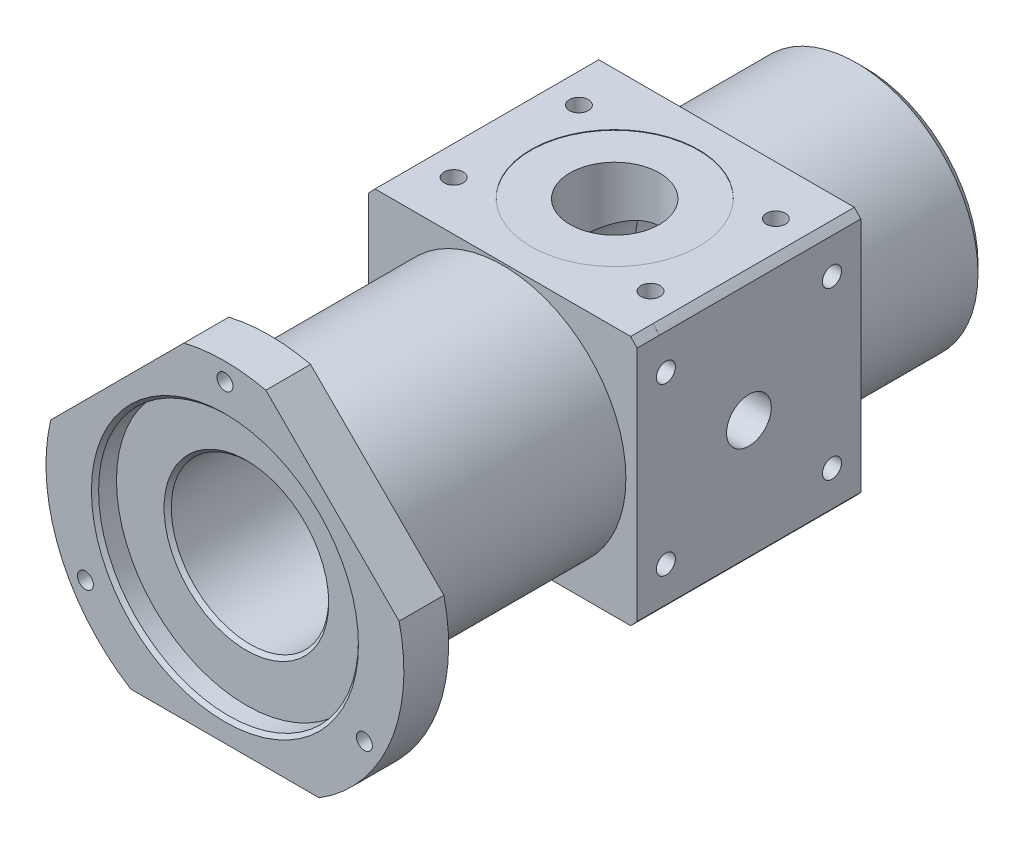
ISO-10303-21;
HEADER;
FILE_DESCRIPTION(('STEP AP214'),'2;1');
FILE_NAME('part.step','',(''),(''),'','','');
FILE_SCHEMA(('AUTOMOTIVE_DESIGN { 1 0 10303 214 1 1 1 1 }'));
ENDSEC;
DATA;
#1=APPLICATION_CONTEXT('core data for automotive mechanical design processes');
#2=APPLICATION_PROTOCOL_DEFINITION('international standard','automotive_design',2000,#1);
#3=PRODUCT_CONTEXT('',#1,'mechanical');
#4=PRODUCT('Part','Part','',(#3));
#5=PRODUCT_RELATED_PRODUCT_CATEGORY('part','',(#4));
#6=PRODUCT_DEFINITION_FORMATION('','',#4);
#7=PRODUCT_DEFINITION_CONTEXT('part definition',#1,'design');
#8=PRODUCT_DEFINITION('design','',#6,#7);
#9=PRODUCT_DEFINITION_SHAPE('','',#8);
#10=(LENGTH_UNIT() NAMED_UNIT(*) SI_UNIT(.MILLI.,.METRE.));
#11=(NAMED_UNIT(*) PLANE_ANGLE_UNIT() SI_UNIT($,.RADIAN.));
#12=(NAMED_UNIT(*) SI_UNIT($,.STERADIAN.) SOLID_ANGLE_UNIT());
#13=UNCERTAINTY_MEASURE_WITH_UNIT(LENGTH_MEASURE(1.E-05),#10,'distance_accuracy_value','');
#14=(GEOMETRIC_REPRESENTATION_CONTEXT(3) GLOBAL_UNCERTAINTY_ASSIGNED_CONTEXT((#13)) GLOBAL_UNIT_ASSIGNED_CONTEXT((#10,
#11,#12)) REPRESENTATION_CONTEXT('',''));
#15=CARTESIAN_POINT('',(0.,0.,0.));
#16=DIRECTION('',(0.,0.,1.));
#17=DIRECTION('',(1.,0.,0.));
#18=AXIS2_PLACEMENT_3D('',#15,#16,#17);
#19=CARTESIAN_POINT('',(0.,0.,36.0934000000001));
#20=DIRECTION('',(0.,0.,-1.));
#21=DIRECTION('',(-1.,0.,0.));
#22=AXIS2_PLACEMENT_3D('',#19,#20,#21);
#23=CONICAL_SURFACE('',#22,11.0109,0.256151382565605);
#24=CARTESIAN_POINT('',(10.5566504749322,3.12983961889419,36.0936000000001));
#25=CARTESIAN_POINT('',(10.5665285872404,3.13740554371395,36.0492257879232));
#26=CARTESIAN_POINT('',(10.5767142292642,3.14401502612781,36.0047578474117));
#27=CARTESIAN_POINT('',(10.5976590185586,3.15531868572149,35.9158012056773));
#28=CARTESIAN_POINT('',(10.6084170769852,3.16001636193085,35.8713126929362));
#29=CARTESIAN_POINT('',(10.6305015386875,3.1675217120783,35.7823181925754));
#30=CARTESIAN_POINT('',(10.641827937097,3.17032940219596,35.7378122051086));
#31=CARTESIAN_POINT('',(10.6650429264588,3.17407194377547,35.6487803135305));
#32=CARTESIAN_POINT('',(10.6769325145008,3.17500333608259,35.6042545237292));
#33=CARTESIAN_POINT('',(10.6890796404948,3.17499999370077,35.5598));
#34=B_SPLINE_CURVE_WITH_KNOTS('',3,(#24,#25,#26,#27,#28,#29,#30,#31,#32,#33),.UNSPECIFIED.,.F.,
.F.,(4,2,2,2,4),(0.,0.138244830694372,0.276235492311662,0.414224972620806,0.552468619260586),.UNSPECIFIED.);
#35=CARTESIAN_POINT('',(10.5566950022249,3.12987370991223,36.0934000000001));
#36=VERTEX_POINT('',#35);
#37=CARTESIAN_POINT('',(10.6890249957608,3.17499999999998,35.56));
#38=VERTEX_POINT('',#37);
#39=EDGE_CURVE('E331',#36,#38,#34,.T.);
#40=ORIENTED_EDGE('',*,*,#39,.F.);
#41=CARTESIAN_POINT('',(0.,0.,36.0934000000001));
#42=DIRECTION('',(0.,0.,-1.));
#43=DIRECTION('',(-1.,0.,0.));
#44=AXIS2_PLACEMENT_3D('',#41,#42,#43);
#45=CIRCLE('',#44,11.0109);
#46=CARTESIAN_POINT('',(6.32755754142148,9.01121159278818,36.0934000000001));
#47=VERTEX_POINT('',#46);
#48=EDGE_CURVE('E481',#47,#36,#45,.T.);
#49=ORIENTED_EDGE('',*,*,#48,.F.);
#50=CARTESIAN_POINT('',(6.34999999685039,9.16594504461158,35.5598));
#51=CARTESIAN_POINT('',(6.35003050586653,9.1377318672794,35.6482250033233));
#52=CARTESIAN_POINT('',(6.34817415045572,9.11072647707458,35.7369208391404));
#53=CARTESIAN_POINT('',(6.3406877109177,9.05913127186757,35.9148541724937));
#54=CARTESIAN_POINT('',(6.33505762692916,9.03454145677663,36.0040916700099));
#55=CARTESIAN_POINT('',(6.32754067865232,9.01115942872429,36.0936000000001));
#56=B_SPLINE_CURVE_WITH_KNOTS('',3,(#50,#51,#52,#53,#54,#55),.UNSPECIFIED.,.F.,.F.,(4,2,4),(0.,
0.278203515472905,0.55640702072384),.UNSPECIFIED.);
#57=CARTESIAN_POINT('',(6.35,9.16588131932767,35.56));
#58=VERTEX_POINT('',#57);
#59=EDGE_CURVE('E381',#58,#47,#56,.T.);
#60=ORIENTED_EDGE('',*,*,#59,.F.);
#61=CARTESIAN_POINT('',(0.,0.,35.56));
#62=DIRECTION('',(0.,0.,-1.));
#63=DIRECTION('',(-1.,0.,0.));
#64=AXIS2_PLACEMENT_3D('',#61,#62,#63);
#65=CIRCLE('',#64,11.1506);
#66=EDGE_CURVE('E511',#58,#38,#65,.T.);
#67=ORIENTED_EDGE('',*,*,#66,.T.);
#68=EDGE_LOOP('',(#40,#49,#60,#67));
#69=FACE_BOUND('',#68,.T.);
#70=ADVANCED_FACE('F49',(#69),#23,.F.);
#71=CARTESIAN_POINT('',(0.,0.,48.26));
#72=DIRECTION('',(0.,0.,-1.));
#73=DIRECTION('',(-1.,0.,0.));
#74=AXIS2_PLACEMENT_3D('',#71,#72,#73);
#75=PLANE('',#74);
#76=DIRECTION('',(-0.680954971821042,0.732325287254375,0.));
#77=VECTOR('',#76,1.);
#78=CARTESIAN_POINT('',(-0.267993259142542,37.5758371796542,48.26));
#79=LINE('',#78,#77);
#80=CARTESIAN_POINT('',(19.05,16.8005208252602,48.26));
#81=VERTEX_POINT('',#80);
#82=CARTESIAN_POINT('',(18.1392282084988,17.78,48.26));
#83=VERTEX_POINT('',#82);
#84=EDGE_CURVE('E71',#81,#83,#79,.T.);
#85=ORIENTED_EDGE('',*,*,#84,.F.);
#86=CARTESIAN_POINT('',(0.,0.,48.26));
#87=DIRECTION('',(0.,0.,-1.));
#88=DIRECTION('',(-1.,0.,0.));
#89=AXIS2_PLACEMENT_3D('',#86,#87,#88);
#90=CIRCLE('',#89,25.4);
#91=EDGE_CURVE('E460',#83,#81,#90,.T.);
#92=ORIENTED_EDGE('',*,*,#91,.F.);
#93=EDGE_LOOP('',(#85,#92));
#94=FACE_BOUND('',#93,.T.);
#95=ADVANCED_FACE('F559',(#94),#75,.F.);
#96=CARTESIAN_POINT('',(0.,0.,73.66));
#97=DIRECTION('',(0.,0.,-1.));
#98=DIRECTION('',(-1.,0.,0.));
#99=AXIS2_PLACEMENT_3D('',#96,#97,#98);
#100=CYLINDRICAL_SURFACE('',#99,17.4625);
#101=CARTESIAN_POINT('',(0.,0.,84.5312));
#102=DIRECTION('',(0.,0.,1.));
#103=DIRECTION('',(1.,0.,0.));
#104=AXIS2_PLACEMENT_3D('',#101,#102,#103);
#105=CIRCLE('',#104,17.4625);
#106=CARTESIAN_POINT('',(17.4625,0.,84.5312));
#107=VERTEX_POINT('',#106);
#108=EDGE_CURVE('E666',#107,#107,#105,.T.);
#109=ORIENTED_EDGE('',*,*,#108,.F.);
#110=EDGE_LOOP('',(#109));
#111=FACE_BOUND('',#110,.T.);
#112=CARTESIAN_POINT('',(0.,0.,51.435));
#113=DIRECTION('',(0.,0.,-1.));
#114=DIRECTION('',(-1.,0.,0.));
#115=AXIS2_PLACEMENT_3D('',#112,#113,#114);
#116=CIRCLE('',#115,17.4625);
#117=CARTESIAN_POINT('',(-17.4625,0.,51.435));
#118=VERTEX_POINT('',#117);
#119=EDGE_CURVE('E629',#118,#118,#116,.F.);
#120=ORIENTED_EDGE('',*,*,#119,.T.);
#121=EDGE_LOOP('',(#120));
#122=FACE_BOUND('',#121,.T.);
#123=ADVANCED_FACE('F563',(#111,#122),#100,.T.);
#124=CARTESIAN_POINT('',(0.,0.,90.8812));
#125=DIRECTION('',(0.,0.,-1.));
#126=DIRECTION('',(-1.,0.,0.));
#127=AXIS2_PLACEMENT_3D('',#124,#125,#126);
#128=CYLINDRICAL_SURFACE('',#127,25.4);
#129=DIRECTION('',(0.,0.,-1.));
#130=VECTOR('',#129,1.);
#131=CARTESIAN_POINT('',(19.05,-16.8005208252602,90.8812));
#132=LINE('',#131,#130);
#133=CARTESIAN_POINT('',(19.05,-16.8005208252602,19.685));
#134=VERTEX_POINT('',#133);
#135=CARTESIAN_POINT('',(19.05,-16.8005208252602,51.435));
#136=VERTEX_POINT('',#135);
#137=EDGE_CURVE('E659',#134,#136,#132,.F.);
#138=ORIENTED_EDGE('',*,*,#137,.T.);
#139=CARTESIAN_POINT('',(0.,0.,51.435));
#140=DIRECTION('',(0.,0.,-1.));
#141=DIRECTION('',(-1.,0.,0.));
#142=AXIS2_PLACEMENT_3D('',#139,#140,#141);
#143=CIRCLE('',#142,25.4);
#144=CARTESIAN_POINT('',(18.1392282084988,-17.78,51.435));
#145=VERTEX_POINT('',#144);
#146=EDGE_CURVE('E624',#145,#136,#143,.F.);
#147=ORIENTED_EDGE('',*,*,#146,.F.);
#148=DIRECTION('',(0.,0.,-1.));
#149=VECTOR('',#148,1.);
#150=CARTESIAN_POINT('',(18.1392282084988,-17.78,90.8812));
#151=LINE('',#150,#149);
#152=CARTESIAN_POINT('',(18.1392282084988,-17.78,19.685));
#153=VERTEX_POINT('',#152);
#154=EDGE_CURVE('E657',#145,#153,#151,.T.);
#155=ORIENTED_EDGE('',*,*,#154,.T.);
#156=CARTESIAN_POINT('',(0.,0.,19.685));
#157=DIRECTION('',(0.,0.,-1.));
#158=DIRECTION('',(-1.,0.,0.));
#159=AXIS2_PLACEMENT_3D('',#156,#157,#158);
#160=CIRCLE('',#159,25.4);
#161=EDGE_CURVE('E652',#134,#153,#160,.T.);
#162=ORIENTED_EDGE('',*,*,#161,.F.);
#163=EDGE_LOOP('',(#138,#147,#155,#162));
#164=FACE_BOUND('',#163,.T.);
#165=ADVANCED_FACE('F568',(#164),#128,.T.);
#166=ORIENTED_EDGE('',*,*,#91,.T.);
#167=DIRECTION('',(0.,0.,-1.));
#168=VECTOR('',#167,1.);
#169=CARTESIAN_POINT('',(19.05,16.8005208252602,90.8812));
#170=LINE('',#169,#168);
#171=CARTESIAN_POINT('',(19.05,16.8005208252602,19.685));
#172=VERTEX_POINT('',#171);
#173=EDGE_CURVE('E661',#81,#172,#170,.T.);
#174=ORIENTED_EDGE('',*,*,#173,.T.);
#175=CARTESIAN_POINT('',(0.,0.,19.685));
#176=DIRECTION('',(0.,0.,-1.));
#177=DIRECTION('',(-1.,0.,0.));
#178=AXIS2_PLACEMENT_3D('',#175,#176,#177);
#179=CIRCLE('',#178,25.4);
#180=CARTESIAN_POINT('',(18.1392282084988,17.78,19.685));
#181=VERTEX_POINT('',#180);
#182=EDGE_CURVE('E646',#181,#172,#179,.T.);
#183=ORIENTED_EDGE('',*,*,#182,.F.);
#184=DIRECTION('',(0.,0.,-1.));
#185=VECTOR('',#184,1.);
#186=CARTESIAN_POINT('',(18.1392282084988,17.78,90.8812));
#187=LINE('',#186,#185);
#188=EDGE_CURVE('E398',#181,#83,#187,.F.);
#189=ORIENTED_EDGE('',*,*,#188,.T.);
#190=EDGE_LOOP('',(#166,#174,#183,#189));
#191=FACE_BOUND('',#190,.T.);
#192=ADVANCED_FACE('F752',(#191),#128,.T.);
#193=DIRECTION('',(0.,0.,-1.));
#194=VECTOR('',#193,1.);
#195=CARTESIAN_POINT('',(-19.05,-16.8005208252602,90.8812));
#196=LINE('',#195,#194);
#197=CARTESIAN_POINT('',(-19.05,-16.8005208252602,51.435));
#198=VERTEX_POINT('',#197);
#199=CARTESIAN_POINT('',(-19.05,-16.8005208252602,19.685));
#200=VERTEX_POINT('',#199);
#201=EDGE_CURVE('E664',#198,#200,#196,.T.);
#202=ORIENTED_EDGE('',*,*,#201,.T.);
#203=CARTESIAN_POINT('',(0.,0.,19.685));
#204=DIRECTION('',(0.,0.,-1.));
#205=DIRECTION('',(-1.,0.,0.));
#206=AXIS2_PLACEMENT_3D('',#203,#204,#205);
#207=CIRCLE('',#206,25.4);
#208=CARTESIAN_POINT('',(-18.1392282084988,-17.78,19.685));
#209=VERTEX_POINT('',#208);
#210=EDGE_CURVE('E637',#209,#200,#207,.T.);
#211=ORIENTED_EDGE('',*,*,#210,.F.);
#212=DIRECTION('',(0.,0.,-1.));
#213=VECTOR('',#212,1.);
#214=CARTESIAN_POINT('',(-18.1392282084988,-17.78,90.8812));
#215=LINE('',#214,#213);
#216=CARTESIAN_POINT('',(-18.1392282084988,-17.78,51.435));
#217=VERTEX_POINT('',#216);
#218=EDGE_CURVE('E655',#209,#217,#215,.F.);
#219=ORIENTED_EDGE('',*,*,#218,.T.);
#220=CARTESIAN_POINT('',(0.,0.,51.435));
#221=DIRECTION('',(0.,0.,-1.));
#222=DIRECTION('',(-1.,0.,0.));
#223=AXIS2_PLACEMENT_3D('',#220,#221,#222);
#224=CIRCLE('',#223,25.4);
#225=EDGE_CURVE('E618',#198,#217,#224,.F.);
#226=ORIENTED_EDGE('',*,*,#225,.F.);
#227=EDGE_LOOP('',(#202,#211,#219,#226));
#228=FACE_BOUND('',#227,.T.);
#229=ADVANCED_FACE('F764',(#228),#128,.T.);
#230=DIRECTION('',(0.,0.,-1.));
#231=VECTOR('',#230,1.);
#232=CARTESIAN_POINT('',(5.80514849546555,24.7277223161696,90.8812));
#233=LINE('',#232,#231);
#234=CARTESIAN_POINT('',(5.80514849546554,24.7277223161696,90.8812));
#235=VERTEX_POINT('',#234);
#236=CARTESIAN_POINT('',(5.80514849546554,24.7277223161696,84.5312));
#237=VERTEX_POINT('',#236);
#238=EDGE_CURVE('E448',#235,#237,#233,.T.);
#239=ORIENTED_EDGE('',*,*,#238,.T.);
#240=CARTESIAN_POINT('',(0.,0.,84.5312));
#241=DIRECTION('',(0.,0.,1.));
#242=DIRECTION('',(1.,0.,0.));
#243=AXIS2_PLACEMENT_3D('',#240,#241,#242);
#244=CIRCLE('',#243,25.4);
#245=CARTESIAN_POINT('',(-5.80514849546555,24.7277223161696,84.5312));
#246=VERTEX_POINT('',#245);
#247=EDGE_CURVE('E671',#237,#246,#244,.T.);
#248=ORIENTED_EDGE('',*,*,#247,.T.);
#249=DIRECTION('',(0.,0.,-1.));
#250=VECTOR('',#249,1.);
#251=CARTESIAN_POINT('',(-5.80514849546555,24.7277223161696,90.8812));
#252=LINE('',#251,#250);
#253=CARTESIAN_POINT('',(-5.80514849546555,24.7277223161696,90.8812));
#254=VERTEX_POINT('',#253);
#255=EDGE_CURVE('E436',#246,#254,#252,.F.);
#256=ORIENTED_EDGE('',*,*,#255,.T.);
#257=CARTESIAN_POINT('',(0.,0.,90.8812));
#258=DIRECTION('',(0.,0.,1.));
#259=DIRECTION('',(1.,0.,0.));
#260=AXIS2_PLACEMENT_3D('',#257,#258,#259);
#261=CIRCLE('',#260,25.4);
#262=EDGE_CURVE('E528',#235,#254,#261,.T.);
#263=ORIENTED_EDGE('',*,*,#262,.F.);
#264=EDGE_LOOP('',(#239,#248,#256,#263));
#265=FACE_BOUND('',#264,.T.);
#266=ADVANCED_FACE('F759',(#265),#128,.T.);
#267=DIRECTION('',(0.,0.,-1.));
#268=VECTOR('',#267,1.);
#269=CARTESIAN_POINT('',(-24.7277223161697,5.80514849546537,90.8812));
#270=LINE('',#269,#268);
#271=CARTESIAN_POINT('',(-24.7277223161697,5.80514849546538,90.8812));
#272=VERTEX_POINT('',#271);
#273=CARTESIAN_POINT('',(-24.7277223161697,5.80514849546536,84.5312));
#274=VERTEX_POINT('',#273);
#275=EDGE_CURVE('E438',#272,#274,#270,.T.);
#276=ORIENTED_EDGE('',*,*,#275,.T.);
#277=CARTESIAN_POINT('',(-13.380280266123,-21.59,84.5312));
#278=VERTEX_POINT('',#277);
#279=EDGE_CURVE('E670',#274,#278,#244,.T.);
#280=ORIENTED_EDGE('',*,*,#279,.T.);
#281=DIRECTION('',(0.,0.,-1.));
#282=VECTOR('',#281,1.);
#283=CARTESIAN_POINT('',(-13.380280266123,-21.59,90.8812));
#284=LINE('',#283,#282);
#285=CARTESIAN_POINT('',(-13.380280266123,-21.59,90.8812));
#286=VERTEX_POINT('',#285);
#287=EDGE_CURVE('E426',#278,#286,#284,.F.);
#288=ORIENTED_EDGE('',*,*,#287,.T.);
#289=EDGE_CURVE('E526',#272,#286,#261,.T.);
#290=ORIENTED_EDGE('',*,*,#289,.F.);
#291=EDGE_LOOP('',(#276,#280,#288,#290));
#292=FACE_BOUND('',#291,.T.);
#293=ADVANCED_FACE('F755',(#292),#128,.T.);
#294=DIRECTION('',(0.,0.,-1.));
#295=VECTOR('',#294,1.);
#296=CARTESIAN_POINT('',(13.380280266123,-21.59,90.8812));
#297=LINE('',#296,#295);
#298=CARTESIAN_POINT('',(13.380280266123,-21.59,90.8812));
#299=VERTEX_POINT('',#298);
#300=CARTESIAN_POINT('',(13.380280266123,-21.59,84.5312));
#301=VERTEX_POINT('',#300);
#302=EDGE_CURVE('E424',#299,#301,#297,.T.);
#303=ORIENTED_EDGE('',*,*,#302,.T.);
#304=CARTESIAN_POINT('',(24.7277223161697,5.80514849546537,84.5312));
#305=VERTEX_POINT('',#304);
#306=EDGE_CURVE('E432',#301,#305,#244,.T.);
#307=ORIENTED_EDGE('',*,*,#306,.T.);
#308=DIRECTION('',(0.,0.,-1.));
#309=VECTOR('',#308,1.);
#310=CARTESIAN_POINT('',(24.7277223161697,5.80514849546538,90.8812));
#311=LINE('',#310,#309);
#312=CARTESIAN_POINT('',(24.7277223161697,5.80514849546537,90.8812));
#313=VERTEX_POINT('',#312);
#314=EDGE_CURVE('E446',#305,#313,#311,.F.);
#315=ORIENTED_EDGE('',*,*,#314,.T.);
#316=EDGE_CURVE('E435',#299,#313,#261,.T.);
#317=ORIENTED_EDGE('',*,*,#316,.F.);
#318=EDGE_LOOP('',(#303,#307,#315,#317));
#319=FACE_BOUND('',#318,.T.);
#320=ADVANCED_FACE('F372',(#319),#128,.T.);
#321=CARTESIAN_POINT('',(0.,-1.27,35.56));
#322=DIRECTION('',(0.,1.,0.));
#323=DIRECTION('',(0.,0.,1.));
#324=AXIS2_PLACEMENT_3D('',#321,#322,#323);
#325=CYLINDRICAL_SURFACE('',#324,6.35);
#326=CARTESIAN_POINT('',(-6.32754067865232,9.01115942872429,36.0936000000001));
#327=CARTESIAN_POINT('',(-6.33505762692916,9.03454145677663,36.0040916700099));
#328=CARTESIAN_POINT('',(-6.3406877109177,9.05913127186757,35.9148541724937));
#329=CARTESIAN_POINT('',(-6.34817415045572,9.11072647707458,35.7369208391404));
#330=CARTESIAN_POINT('',(-6.35003050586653,9.1377318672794,35.6482250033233));
#331=CARTESIAN_POINT('',(-6.34999999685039,9.16594504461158,35.5598));
#332=B_SPLINE_CURVE_WITH_KNOTS('',3,(#326,#327,#328,#329,#330,#331),.UNSPECIFIED.,.F.,.F.,(4,2,
4),(0.,0.278203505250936,0.556407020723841),.UNSPECIFIED.);
#333=CARTESIAN_POINT('',(-6.32755754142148,9.01121159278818,36.0934000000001));
#334=VERTEX_POINT('',#333);
#335=CARTESIAN_POINT('',(-6.35,9.16588131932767,35.56));
#336=VERTEX_POINT('',#335);
#337=EDGE_CURVE('E388',#334,#336,#332,.T.);
#338=ORIENTED_EDGE('',*,*,#337,.T.);
#339=CARTESIAN_POINT('',(6.35,9.16588131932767,35.56));
#340=CARTESIAN_POINT('',(6.35003507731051,9.16581899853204,35.3975359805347));
#341=CARTESIAN_POINT('',(6.34376680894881,9.17019885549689,35.2351038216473));
#342=CARTESIAN_POINT('',(6.31889570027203,9.18737449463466,34.9117680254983));
#343=CARTESIAN_POINT('',(6.30030329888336,9.20016315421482,34.7508632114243));
#344=CARTESIAN_POINT('',(6.25123377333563,9.23356786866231,34.4329245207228));
#345=CARTESIAN_POINT('',(6.22084381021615,9.25412648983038,34.2758710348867));
#346=CARTESIAN_POINT('',(6.14861633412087,9.30227341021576,33.9655085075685));
#347=CARTESIAN_POINT('',(6.10677687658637,9.32986290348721,33.812200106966));
#348=CARTESIAN_POINT('',(6.01232174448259,9.39100700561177,33.5107683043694));
#349=CARTESIAN_POINT('',(5.95974327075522,9.4245409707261,33.3626290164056));
#350=CARTESIAN_POINT('',(5.84424530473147,9.49659470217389,33.0716635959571));
#351=CARTESIAN_POINT('',(5.78132178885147,9.53511640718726,32.9288395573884));
#352=CARTESIAN_POINT('',(5.57760747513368,9.65666602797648,32.5088201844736));
#353=CARTESIAN_POINT('',(5.4219763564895,9.74560831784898,32.240403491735));
#354=CARTESIAN_POINT('',(5.05604781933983,9.94080720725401,31.7030980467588));
#355=CARTESIAN_POINT('',(4.84165799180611,10.0478959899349,31.4372993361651));
#356=CARTESIAN_POINT('',(4.49025253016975,10.2073580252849,31.0667658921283));
#357=CARTESIAN_POINT('',(4.368078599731,10.2603430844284,30.9478963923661));
#358=CARTESIAN_POINT('',(4.11414566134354,10.3647725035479,30.7200206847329));
#359=CARTESIAN_POINT('',(3.98238507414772,10.4162166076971,30.6110161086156));
#360=CARTESIAN_POINT('',(3.69693075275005,10.5211141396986,30.3937295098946));
#361=CARTESIAN_POINT('',(3.54234126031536,10.574297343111,30.2864911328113));
#362=CARTESIAN_POINT('',(3.22318358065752,10.6759072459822,30.0855940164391));
#363=CARTESIAN_POINT('',(3.05861981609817,10.7243360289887,29.9919293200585));
#364=CARTESIAN_POINT('',(2.72047230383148,10.8150608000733,29.8191319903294));
#365=CARTESIAN_POINT('',(2.54689158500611,10.8573588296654,29.7399945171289));
#366=CARTESIAN_POINT('',(2.19188459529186,10.9345553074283,29.5972214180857));
#367=CARTESIAN_POINT('',(2.01045946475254,10.9694548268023,29.5335835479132));
#368=CARTESIAN_POINT('',(1.65749600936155,11.0280426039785,29.427617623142));
#369=CARTESIAN_POINT('',(1.48649089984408,11.0524467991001,29.3839078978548));
#370=CARTESIAN_POINT('',(1.14053186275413,11.0934844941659,29.3107650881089));
#371=CARTESIAN_POINT('',(0.965578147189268,11.1101184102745,29.2813312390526));
#372=CARTESIAN_POINT('',(0.613354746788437,11.1351168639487,29.2372017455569));
#373=CARTESIAN_POINT('',(0.436086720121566,11.1434870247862,29.2224960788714));
#374=CARTESIAN_POINT('',(0.080750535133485,11.1517232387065,29.2080248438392));
#375=CARTESIAN_POINT('',(-0.097317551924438,11.1515900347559,29.2082579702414));
#376=CARTESIAN_POINT('',(-0.432606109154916,11.1433218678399,29.2227870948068));
#377=CARTESIAN_POINT('',(-0.589920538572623,11.1360878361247,29.2354997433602));
#378=CARTESIAN_POINT('',(-0.902791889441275,11.1150993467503,29.272529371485));
#379=CARTESIAN_POINT('',(-1.05834821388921,11.10134273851,29.2968501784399));
#380=CARTESIAN_POINT('',(-1.3665174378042,11.0676344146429,29.3567940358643));
#381=CARTESIAN_POINT('',(-1.51913138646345,11.0476849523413,29.3924129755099));
#382=CARTESIAN_POINT('',(-1.8205651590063,11.0020304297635,29.4745699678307));
#383=CARTESIAN_POINT('',(-1.96938347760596,10.9763231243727,29.5211122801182));
#384=CARTESIAN_POINT('',(-2.26358687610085,10.9194637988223,29.6250844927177));
#385=CARTESIAN_POINT('',(-2.40893123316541,10.8882666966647,29.6826049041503));
#386=CARTESIAN_POINT('',(-2.69412081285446,10.8212330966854,29.8077407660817));
#387=CARTESIAN_POINT('',(-2.83396417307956,10.785395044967,29.8753595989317));
#388=CARTESIAN_POINT('',(-3.24420104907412,10.6719900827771,30.0925219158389));
#389=CARTESIAN_POINT('',(-3.50549025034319,10.5884944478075,30.2564387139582));
#390=CARTESIAN_POINT('',(-4.02741313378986,10.4019740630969,30.6387596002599));
#391=CARTESIAN_POINT('',(-4.28466668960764,10.2978090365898,30.8612187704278));
#392=CARTESIAN_POINT('',(-4.6411675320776,10.1396482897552,31.2228563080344));
#393=CARTESIAN_POINT('',(-4.7552046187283,10.0865547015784,31.3482007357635));
#394=CARTESIAN_POINT('',(-4.97305896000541,9.9809416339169,31.6077997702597));
#395=CARTESIAN_POINT('',(-5.07687431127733,9.92842226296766,31.7420560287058));
#396=CARTESIAN_POINT('',(-5.28352337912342,9.8201423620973,32.0327110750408));
#397=CARTESIAN_POINT('',(-5.38523300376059,9.76457883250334,32.1899841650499));
#398=CARTESIAN_POINT('',(-5.57487959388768,9.65755939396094,32.5139475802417));
#399=CARTESIAN_POINT('',(-5.66281812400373,9.60610301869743,32.6806368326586));
#400=CARTESIAN_POINT('',(-5.82387144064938,9.50932227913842,33.0221717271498));
#401=CARTESIAN_POINT('',(-5.89702529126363,9.46398186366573,33.1969943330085));
#402=CARTESIAN_POINT('',(-6.02785750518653,9.38119501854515,33.5541190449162));
#403=CARTESIAN_POINT('',(-6.08554202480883,9.34374544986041,33.7364181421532));
#404=CARTESIAN_POINT('',(-6.17024476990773,9.28793478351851,34.0536059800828));
#405=CARTESIAN_POINT('',(-6.20130939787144,9.26718329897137,34.1870080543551));
#406=CARTESIAN_POINT('',(-6.25483948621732,9.23113760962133,34.456228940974));
#407=CARTESIAN_POINT('',(-6.27730750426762,9.2158417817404,34.5920470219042));
#408=CARTESIAN_POINT('',(-6.31348703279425,9.19109752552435,34.8660585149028));
#409=CARTESIAN_POINT('',(-6.32715518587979,9.18167805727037,35.0042602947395));
#410=CARTESIAN_POINT('',(-6.34542428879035,9.16905083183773,35.2816356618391));
#411=CARTESIAN_POINT('',(-6.35001910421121,9.16584727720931,35.4208098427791));
#412=CARTESIAN_POINT('',(-6.35,9.16588131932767,35.56));
#413=B_SPLINE_CURVE_WITH_KNOTS('',3,(#339,#340,#341,#342,#343,#344,#345,#346,#347,#348,#349,
#350,#351,#352,#353,#354,#355,#356,#357,#358,#359,#360,#361,#362,#363,#364,#365,#366,#367,#368,
#369,#370,#371,#372,#373,#374,#375,#376,#377,#378,#379,#380,#381,#382,#383,#384,#385,#386,#387,
#388,#389,#390,#391,#392,#393,#394,#395,#396,#397,#398,#399,#400,#401,#402,#403,#404,#405,#406,
#407,#408,#409,#410,#411,#412),.UNSPECIFIED.,.F.,.F.,(4,2,2,2,2,2,2,2,2,2,2,2,2,2,2,2,2,2,2,2,2,
2,2,2,2,2,2,2,2,2,2,2,2,2,2,2,4),(0.,0.487161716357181,0.973911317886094,1.45713120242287,
1.94043320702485,2.42208857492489,2.90393172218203,3.86865395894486,4.93773736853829,
5.47281519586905,6.00798136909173,6.59376906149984,7.17929888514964,7.76463327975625,
8.34988286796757,8.88367570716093,9.41743995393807,9.95084073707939,10.4841949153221,
10.9576100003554,11.4311812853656,11.9045804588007,12.3781645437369,12.8558364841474,
13.3336687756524,14.2887274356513,15.3512211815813,15.8835420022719,16.4159617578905,
17.0013233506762,17.5866183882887,18.1703461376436,18.753841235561,19.1690849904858,
19.5842051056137,20.0013551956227,20.4187872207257),.UNSPECIFIED.);
#414=EDGE_CURVE('E350',#58,#336,#413,.T.);
#415=ORIENTED_EDGE('',*,*,#414,.F.);
#416=ORIENTED_EDGE('',*,*,#59,.T.);
#417=CARTESIAN_POINT('',(-6.32755754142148,9.01121159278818,36.0934000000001));
#418=CARTESIAN_POINT('',(-6.31342195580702,9.02110076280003,36.2614527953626));
#419=CARTESIAN_POINT('',(-6.29256107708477,9.03573611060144,36.4285879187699));
#420=CARTESIAN_POINT('',(-6.23791205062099,9.07356862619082,36.7595618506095));
#421=CARTESIAN_POINT('',(-6.20413843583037,9.09675616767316,36.92340414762));
#422=CARTESIAN_POINT('',(-6.12443100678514,9.15060122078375,37.2455918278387));
#423=CARTESIAN_POINT('',(-6.07858325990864,9.18120574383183,37.403967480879));
#424=CARTESIAN_POINT('',(-5.97524113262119,9.2487967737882,37.7154471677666));
#425=CARTESIAN_POINT('',(-5.91774367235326,9.28578496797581,37.868549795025));
#426=CARTESIAN_POINT('',(-5.72917752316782,9.40416631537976,38.3175226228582));
#427=CARTESIAN_POINT('',(-5.581621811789,9.49327166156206,38.604695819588));
#428=CARTESIAN_POINT('',(-5.3306965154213,9.63498211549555,39.0142717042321));
#429=CARTESIAN_POINT('',(-5.24197531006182,9.68363603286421,39.1474407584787));
#430=CARTESIAN_POINT('',(-5.05502438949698,9.78252620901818,39.4063871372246));
#431=CARTESIAN_POINT('',(-4.95679409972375,9.83276256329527,39.5321640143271));
#432=CARTESIAN_POINT('',(-4.73875482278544,9.93984981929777,39.7906836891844));
#433=CARTESIAN_POINT('',(-4.61777443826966,9.99676202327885,39.9224128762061));
#434=CARTESIAN_POINT('',(-4.36493525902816,10.1097195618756,40.1753889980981));
#435=CARTESIAN_POINT('',(-4.23307652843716,10.1657649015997,40.2966359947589));
#436=CARTESIAN_POINT('',(-3.95903294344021,10.2755906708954,40.527968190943));
#437=CARTESIAN_POINT('',(-3.81684877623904,10.3293712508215,40.6380541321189));
#438=CARTESIAN_POINT('',(-3.52274091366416,10.4333380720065,40.84632829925));
#439=CARTESIAN_POINT('',(-3.37081608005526,10.4835238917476,40.9445151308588));
#440=CARTESIAN_POINT('',(-3.05340556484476,10.5804043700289,41.1308216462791));
#441=CARTESIAN_POINT('',(-2.88765363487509,10.6269545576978,41.2185642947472));
#442=CARTESIAN_POINT('',(-2.54770261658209,10.7135369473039,41.3795410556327));
#443=CARTESIAN_POINT('',(-2.3735077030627,10.7535723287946,41.4527822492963));
#444=CARTESIAN_POINT('',(-2.01796645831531,10.8259232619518,41.5838009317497));
#445=CARTESIAN_POINT('',(-1.83662498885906,10.858243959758,41.6415887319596));
#446=CARTESIAN_POINT('',(-1.46822995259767,10.9141608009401,41.7408716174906));
#447=CARTESIAN_POINT('',(-1.28117737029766,10.9377584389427,41.7823694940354));
#448=CARTESIAN_POINT('',(-0.926284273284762,10.9731366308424,41.8443351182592));
#449=CARTESIAN_POINT('',(-0.758890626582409,10.9860091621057,41.8667536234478));
#450=CARTESIAN_POINT('',(-0.42244356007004,11.0040823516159,41.8981840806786));
#451=CARTESIAN_POINT('',(-0.253390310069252,11.0092837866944,41.90719739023));
#452=CARTESIAN_POINT('',(0.0848956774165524,11.0118716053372,41.9116848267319));
#453=CARTESIAN_POINT('',(0.254128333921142,11.0092606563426,41.9071635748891));
#454=CARTESIAN_POINT('',(0.591393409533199,10.9963015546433,41.8846592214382));
#455=CARTESIAN_POINT('',(0.759425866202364,10.9859536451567,41.8666765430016));
#456=CARTESIAN_POINT('',(1.07933891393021,10.9589501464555,41.8195134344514));
#457=CARTESIAN_POINT('',(1.23142210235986,10.9428757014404,41.7913621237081));
#458=CARTESIAN_POINT('',(1.53246881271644,10.9047919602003,41.7242381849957));
#459=CARTESIAN_POINT('',(1.68143134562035,10.8827808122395,41.6852621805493));
#460=CARTESIAN_POINT('',(1.97526546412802,10.8333017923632,41.5969156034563));
#461=CARTESIAN_POINT('',(2.12013815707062,10.8058354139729,41.5475478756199));
#462=CARTESIAN_POINT('',(2.40509180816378,10.7460083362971,41.4388877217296));
#463=CARTESIAN_POINT('',(2.54517090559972,10.7136457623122,41.37959149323));
#464=CARTESIAN_POINT('',(2.97182283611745,10.6064556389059,41.1807195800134));
#465=CARTESIAN_POINT('',(3.2491622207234,10.5242320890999,41.0248587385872));
#466=CARTESIAN_POINT('',(3.7747705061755,10.3473764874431,40.6759904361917));
#467=CARTESIAN_POINT('',(4.02302626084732,10.2527388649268,40.4829662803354));
#468=CARTESIAN_POINT('',(4.51691906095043,10.0457834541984,40.0370825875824));
#469=CARTESIAN_POINT('',(4.75821284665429,9.932747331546,39.7797361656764));
#470=CARTESIAN_POINT('',(5.19617391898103,9.71082310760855,39.226973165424));
#471=CARTESIAN_POINT('',(5.39277444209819,9.60194141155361,38.9315006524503));
#472=CARTESIAN_POINT('',(5.65494549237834,9.44841865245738,38.4547493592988));
#473=CARTESIAN_POINT('',(5.73863198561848,9.39766413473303,38.2851880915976));
#474=CARTESIAN_POINT('',(5.89114671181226,9.302815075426,37.9375805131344));
#475=CARTESIAN_POINT('',(5.95997098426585,9.2587223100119,37.7595319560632));
#476=CARTESIAN_POINT('',(6.0814962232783,9.17935629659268,37.3969353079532));
#477=CARTESIAN_POINT('',(6.13426073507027,9.1440483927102,37.2124161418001));
#478=CARTESIAN_POINT('',(6.22306562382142,9.08384672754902,36.8378543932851));
#479=CARTESIAN_POINT('',(6.25912411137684,9.0589416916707,36.6478180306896));
#480=CARTESIAN_POINT('',(6.29503533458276,9.0339663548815,36.395902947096));
#481=CARTESIAN_POINT('',(6.30275199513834,9.02858262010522,36.3355807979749));
#482=CARTESIAN_POINT('',(6.31645389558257,9.01900220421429,36.2146788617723));
#483=CARTESIAN_POINT('',(6.3224400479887,9.01480489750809,36.1540992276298));
#484=CARTESIAN_POINT('',(6.32755754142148,9.01121159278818,36.0934000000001));
#485=B_SPLINE_CURVE_WITH_KNOTS('',3,(#417,#418,#419,#420,#421,#422,#423,#424,#425,#426,#427,
#428,#429,#430,#431,#432,#433,#434,#435,#436,#437,#438,#439,#440,#441,#442,#443,#444,#445,#446,
#447,#448,#449,#450,#451,#452,#453,#454,#455,#456,#457,#458,#459,#460,#461,#462,#463,#464,#465,
#466,#467,#468,#469,#470,#471,#472,#473,#474,#475,#476,#477,#478,#479,#480,#481,#482,#483,#484),
.UNSPECIFIED.,.F.,.F.,(4,2,2,2,2,2,2,2,2,2,2,2,2,2,2,2,2,2,2,2,2,2,2,2,2,2,2,2,2,2,2,2,2,4),(0.,
0.506499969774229,1.01243155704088,1.51485001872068,2.01740147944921,3.0174193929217,
3.51885806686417,4.02032705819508,4.58279291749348,5.14525546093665,5.7076806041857,
6.27017158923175,6.84906440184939,7.42767383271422,8.005896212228,8.5840194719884,
9.0914664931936,9.59886212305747,10.1060845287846,10.6132909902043,11.0792657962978,
11.5453861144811,12.0113789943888,12.477550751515,13.4590393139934,14.4409698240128,
15.5477036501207,16.656080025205,17.242716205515,17.8295085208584,18.4139478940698,
18.9977521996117,19.1808802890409,19.3639116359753),.UNSPECIFIED.);
#486=EDGE_CURVE('E359',#334,#47,#485,.T.);
#487=ORIENTED_EDGE('',*,*,#486,.F.);
#488=EDGE_LOOP('',(#338,#415,#416,#487));
#489=FACE_BOUND('',#488,.T.);
#490=CARTESIAN_POINT('',(0.,17.7038,35.56));
#491=DIRECTION('',(0.,1.,0.));
#492=DIRECTION('',(0.,0.,1.));
#493=AXIS2_PLACEMENT_3D('',#490,#491,#492);
#494=CIRCLE('',#493,6.35);
#495=CARTESIAN_POINT('',(0.,17.7038,41.91));
#496=VERTEX_POINT('',#495);
#497=EDGE_CURVE('E395',#496,#496,#494,.F.);
#498=ORIENTED_EDGE('',*,*,#497,.F.);
#499=EDGE_LOOP('',(#498));
#500=FACE_BOUND('',#499,.T.);
#501=ADVANCED_FACE('F366',(#489,#500),#325,.F.);
#502=DIRECTION('',(0.,0.,-1.));
#503=VECTOR('',#502,1.);
#504=CARTESIAN_POINT('',(-18.1392282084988,17.78,90.8812));
#505=LINE('',#504,#503);
#506=CARTESIAN_POINT('',(-18.1392282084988,17.78,51.435));
#507=VERTEX_POINT('',#506);
#508=CARTESIAN_POINT('',(-18.1392282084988,17.78,19.685));
#509=VERTEX_POINT('',#508);
#510=EDGE_CURVE('E469',#507,#509,#505,.T.);
#511=ORIENTED_EDGE('',*,*,#510,.T.);
#512=CARTESIAN_POINT('',(0.,0.,19.685));
#513=DIRECTION('',(0.,0.,-1.));
#514=DIRECTION('',(-1.,0.,0.));
#515=AXIS2_PLACEMENT_3D('',#512,#513,#514);
#516=CIRCLE('',#515,25.4);
#517=CARTESIAN_POINT('',(-19.05,16.8005208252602,19.685));
#518=VERTEX_POINT('',#517);
#519=EDGE_CURVE('E643',#518,#509,#516,.T.);
#520=ORIENTED_EDGE('',*,*,#519,.F.);
#521=DIRECTION('',(0.,0.,-1.));
#522=VECTOR('',#521,1.);
#523=CARTESIAN_POINT('',(-19.05,16.8005208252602,90.8812));
#524=LINE('',#523,#522);
#525=CARTESIAN_POINT('',(-19.05,16.8005208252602,51.435));
#526=VERTEX_POINT('',#525);
#527=EDGE_CURVE('E602',#518,#526,#524,.F.);
#528=ORIENTED_EDGE('',*,*,#527,.T.);
#529=CARTESIAN_POINT('',(0.,0.,51.435));
#530=DIRECTION('',(0.,0.,-1.));
#531=DIRECTION('',(-1.,0.,0.));
#532=AXIS2_PLACEMENT_3D('',#529,#530,#531);
#533=CIRCLE('',#532,25.4);
#534=EDGE_CURVE('E601',#507,#526,#533,.F.);
#535=ORIENTED_EDGE('',*,*,#534,.F.);
#536=EDGE_LOOP('',(#511,#520,#528,#535));
#537=FACE_BOUND('',#536,.T.);
#538=ADVANCED_FACE('F371',(#537),#128,.T.);
#539=CARTESIAN_POINT('',(0.,0.,0.));
#540=DIRECTION('',(0.,0.,1.));
#541=DIRECTION('',(1.,0.,0.));
#542=AXIS2_PLACEMENT_3D('',#539,#540,#541);
#543=PLANE('',#542);
#544=CARTESIAN_POINT('',(0.,0.,0.));
#545=DIRECTION('',(0.,0.,1.));
#546=DIRECTION('',(1.,0.,0.));
#547=AXIS2_PLACEMENT_3D('',#544,#545,#546);
#548=CIRCLE('',#547,16.002);
#549=CARTESIAN_POINT('',(16.002,0.,0.));
#550=VERTEX_POINT('',#549);
#551=EDGE_CURVE('E501',#550,#550,#548,.F.);
#552=ORIENTED_EDGE('',*,*,#551,.T.);
#553=EDGE_LOOP('',(#552));
#554=FACE_BOUND('',#553,.T.);
#555=CARTESIAN_POINT('',(0.,0.,0.));
#556=DIRECTION('',(0.,0.,1.));
#557=DIRECTION('',(1.,0.,0.));
#558=AXIS2_PLACEMENT_3D('',#555,#556,#557);
#559=CIRCLE('',#558,12.93622);
#560=CARTESIAN_POINT('',(12.93622,0.,0.));
#561=VERTEX_POINT('',#560);
#562=EDGE_CURVE('E493',#561,#561,#559,.T.);
#563=ORIENTED_EDGE('',*,*,#562,.T.);
#564=EDGE_LOOP('',(#563));
#565=FACE_BOUND('',#564,.T.);
#566=ADVANCED_FACE('F744',(#554,#565),#543,.F.);
#567=CARTESIAN_POINT('',(0.,0.,0.));
#568=DIRECTION('',(0.,0.,1.));
#569=DIRECTION('',(1.,0.,0.));
#570=AXIS2_PLACEMENT_3D('',#567,#568,#569);
#571=CYLINDRICAL_SURFACE('',#570,8.9916);
#572=CARTESIAN_POINT('',(0.,0.,61.8236));
#573=DIRECTION('',(0.,0.,1.));
#574=DIRECTION('',(1.,0.,0.));
#575=AXIS2_PLACEMENT_3D('',#572,#573,#574);
#576=CIRCLE('',#575,8.9916);
#577=CARTESIAN_POINT('',(8.9916,0.,61.8236));
#578=VERTEX_POINT('',#577);
#579=EDGE_CURVE('E536',#578,#578,#576,.T.);
#580=ORIENTED_EDGE('',*,*,#579,.T.);
#581=EDGE_LOOP('',(#580));
#582=FACE_BOUND('',#581,.T.);
#583=CARTESIAN_POINT('',(0.,0.,57.5818));
#584=DIRECTION('',(0.,0.,-1.));
#585=DIRECTION('',(-1.,0.,0.));
#586=AXIS2_PLACEMENT_3D('',#583,#584,#585);
#587=CIRCLE('',#586,8.9916);
#588=CARTESIAN_POINT('',(-8.9916,0.,57.5818));
#589=VERTEX_POINT('',#588);
#590=EDGE_CURVE('E530',#589,#589,#587,.F.);
#591=ORIENTED_EDGE('',*,*,#590,.F.);
#592=EDGE_LOOP('',(#591));
#593=FACE_BOUND('',#592,.T.);
#594=ADVANCED_FACE('F738',(#582,#593),#571,.F.);
#595=CARTESIAN_POINT('',(0.,0.,62.5856));
#596=DIRECTION('',(0.,0.,1.));
#597=DIRECTION('',(1.,0.,0.));
#598=AXIS2_PLACEMENT_3D('',#595,#596,#597);
#599=CYLINDRICAL_SURFACE('',#598,11.176);
#600=CARTESIAN_POINT('',(0.,0.,87.3252));
#601=DIRECTION('',(0.,0.,1.));
#602=DIRECTION('',(1.,0.,0.));
#603=AXIS2_PLACEMENT_3D('',#600,#601,#602);
#604=CIRCLE('',#603,11.176);
#605=CARTESIAN_POINT('',(11.176,0.,87.3252));
#606=VERTEX_POINT('',#605);
#607=EDGE_CURVE('E402',#606,#606,#604,.T.);
#608=ORIENTED_EDGE('',*,*,#607,.T.);
#609=EDGE_LOOP('',(#608));
#610=FACE_BOUND('',#609,.T.);
#611=CARTESIAN_POINT('',(0.,0.,62.5856));
#612=DIRECTION('',(0.,0.,1.));
#613=DIRECTION('',(1.,0.,0.));
#614=AXIS2_PLACEMENT_3D('',#611,#612,#613);
#615=CIRCLE('',#614,11.176);
#616=CARTESIAN_POINT('',(11.176,0.,62.5856));
#617=VERTEX_POINT('',#616);
#618=EDGE_CURVE('E523',#617,#617,#615,.T.);
#619=ORIENTED_EDGE('',*,*,#618,.F.);
#620=EDGE_LOOP('',(#619));
#621=FACE_BOUND('',#620,.T.);
#622=ADVANCED_FACE('F727',(#610,#621),#599,.F.);
#623=CARTESIAN_POINT('',(0.,0.,90.8812));
#624=DIRECTION('',(0.,0.,1.));
#625=DIRECTION('',(1.,0.,0.));
#626=AXIS2_PLACEMENT_3D('',#623,#624,#625);
#627=PLANE('',#626);
#628=DIRECTION('',(-1.,0.,0.));
#629=VECTOR('',#628,1.);
#630=CARTESIAN_POINT('',(0.,-21.59,90.8812));
#631=LINE('',#630,#629);
#632=EDGE_CURVE('E417',#299,#286,#631,.T.);
#633=ORIENTED_EDGE('',*,*,#632,.F.);
#634=ORIENTED_EDGE('',*,*,#316,.T.);
#635=DIRECTION('',(0.707106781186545,-0.70710678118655,0.));
#636=VECTOR('',#635,1.);
#637=CARTESIAN_POINT('',(15.2664354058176,15.2664354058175,90.8812));
#638=LINE('',#637,#636);
#639=EDGE_CURVE('E414',#235,#313,#638,.T.);
#640=ORIENTED_EDGE('',*,*,#639,.F.);
#641=ORIENTED_EDGE('',*,*,#262,.T.);
#642=DIRECTION('',(0.707106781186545,0.70710678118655,0.));
#643=VECTOR('',#642,1.);
#644=CARTESIAN_POINT('',(-15.2664354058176,15.2664354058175,90.8812));
#645=LINE('',#644,#643);
#646=EDGE_CURVE('E411',#272,#254,#645,.T.);
#647=ORIENTED_EDGE('',*,*,#646,.F.);
#648=ORIENTED_EDGE('',*,*,#289,.T.);
#649=EDGE_LOOP('',(#633,#634,#640,#641,#647,#648));
#650=FACE_BOUND('',#649,.T.);
#651=CARTESIAN_POINT('',(0.,0.,90.8812));
#652=DIRECTION('',(0.,0.,1.));
#653=DIRECTION('',(1.,0.,0.));
#654=AXIS2_PLACEMENT_3D('',#651,#652,#653);
#655=CIRCLE('',#654,18.9484000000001);
#656=CARTESIAN_POINT('',(18.9484000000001,0.,90.8812));
#657=VERTEX_POINT('',#656);
#658=EDGE_CURVE('E408',#657,#657,#655,.F.);
#659=ORIENTED_EDGE('',*,*,#658,.T.);
#660=EDGE_LOOP('',(#659));
#661=FACE_BOUND('',#660,.T.);
#662=CARTESIAN_POINT('',(-19.7973407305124,-11.4299999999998,90.8812));
#663=DIRECTION('',(0.,0.,1.));
#664=DIRECTION('',(1.,0.,0.));
#665=AXIS2_PLACEMENT_3D('',#662,#663,#664);
#666=CIRCLE('',#665,1.1303);
#667=CARTESIAN_POINT('',(-18.6670407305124,-11.4299999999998,90.8812));
#668=VERTEX_POINT('',#667);
#669=EDGE_CURVE('E451',#668,#668,#666,.T.);
#670=ORIENTED_EDGE('',*,*,#669,.F.);
#671=EDGE_LOOP('',(#670));
#672=FACE_BOUND('',#671,.T.);
#673=CARTESIAN_POINT('',(19.7973407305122,-11.4300000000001,90.8812));
#674=DIRECTION('',(0.,0.,1.));
#675=DIRECTION('',(1.,0.,0.));
#676=AXIS2_PLACEMENT_3D('',#673,#674,#675);
#677=CIRCLE('',#676,1.1303);
#678=CARTESIAN_POINT('',(20.9276407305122,-11.4300000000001,90.8812));
#679=VERTEX_POINT('',#678);
#680=EDGE_CURVE('E454',#679,#679,#677,.T.);
#681=ORIENTED_EDGE('',*,*,#680,.F.);
#682=EDGE_LOOP('',(#681));
#683=FACE_BOUND('',#682,.T.);
#684=CARTESIAN_POINT('',(0.,22.86,90.8812));
#685=DIRECTION('',(0.,0.,1.));
#686=DIRECTION('',(1.,0.,0.));
#687=AXIS2_PLACEMENT_3D('',#684,#685,#686);
#688=CIRCLE('',#687,1.1303);
#689=CARTESIAN_POINT('',(1.1303,22.86,90.8812));
#690=VERTEX_POINT('',#689);
#691=EDGE_CURVE('E457',#690,#690,#688,.T.);
#692=ORIENTED_EDGE('',*,*,#691,.F.);
#693=EDGE_LOOP('',(#692));
#694=FACE_BOUND('',#693,.T.);
#695=ADVANCED_FACE('F723',(#650,#661,#672,#683,#694),#627,.T.);
#696=CARTESIAN_POINT('',(0.,0.,62.5856));
#697=DIRECTION('',(0.,0.,1.));
#698=DIRECTION('',(1.,0.,0.));
#699=AXIS2_PLACEMENT_3D('',#696,#697,#698);
#700=PLANE('',#699);
#701=CARTESIAN_POINT('',(0.,0.,62.5856));
#702=DIRECTION('',(0.,0.,1.));
#703=DIRECTION('',(1.,0.,0.));
#704=AXIS2_PLACEMENT_3D('',#701,#702,#703);
#705=CIRCLE('',#704,9.1957772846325);
#706=CARTESIAN_POINT('',(9.1957772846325,0.,62.5856));
#707=VERTEX_POINT('',#706);
#708=EDGE_CURVE('E533',#707,#707,#705,.F.);
#709=ORIENTED_EDGE('',*,*,#708,.T.);
#710=EDGE_LOOP('',(#709));
#711=FACE_BOUND('',#710,.T.);
#712=ORIENTED_EDGE('',*,*,#618,.T.);
#713=EDGE_LOOP('',(#712));
#714=FACE_BOUND('',#713,.T.);
#715=ADVANCED_FACE('F726',(#711,#714),#700,.T.);
#716=CARTESIAN_POINT('',(0.,0.,87.8332));
#717=DIRECTION('',(0.,0.,1.));
#718=DIRECTION('',(1.,0.,0.));
#719=AXIS2_PLACEMENT_3D('',#716,#717,#718);
#720=PLANE('',#719);
#721=CARTESIAN_POINT('',(0.,0.,87.8332));
#722=DIRECTION('',(0.,0.,1.));
#723=DIRECTION('',(1.,0.,0.));
#724=AXIS2_PLACEMENT_3D('',#721,#722,#723);
#725=CIRCLE('',#724,11.684);
#726=CARTESIAN_POINT('',(11.684,0.,87.8332));
#727=VERTEX_POINT('',#726);
#728=EDGE_CURVE('E394',#727,#727,#725,.F.);
#729=ORIENTED_EDGE('',*,*,#728,.T.);
#730=EDGE_LOOP('',(#729));
#731=FACE_BOUND('',#730,.T.);
#732=CARTESIAN_POINT('',(0.,0.,87.8332));
#733=DIRECTION('',(0.,0.,1.));
#734=DIRECTION('',(1.,0.,0.));
#735=AXIS2_PLACEMENT_3D('',#732,#733,#734);
#736=CIRCLE('',#735,18.4404);
#737=CARTESIAN_POINT('',(18.4404,0.,87.8332));
#738=VERTEX_POINT('',#737);
#739=EDGE_CURVE('E520',#738,#738,#736,.T.);
#740=ORIENTED_EDGE('',*,*,#739,.T.);
#741=EDGE_LOOP('',(#740));
#742=FACE_BOUND('',#741,.T.);
#743=ADVANCED_FACE('F735',(#731,#742),#720,.T.);
#744=CARTESIAN_POINT('',(0.,0.,87.8332));
#745=DIRECTION('',(0.,0.,1.));
#746=DIRECTION('',(1.,0.,0.));
#747=AXIS2_PLACEMENT_3D('',#744,#745,#746);
#748=CYLINDRICAL_SURFACE('',#747,18.4404);
#749=CARTESIAN_POINT('',(0.,0.,90.3731999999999));
#750=DIRECTION('',(0.,0.,1.));
#751=DIRECTION('',(1.,0.,0.));
#752=AXIS2_PLACEMENT_3D('',#749,#750,#751);
#753=CIRCLE('',#752,18.4404);
#754=CARTESIAN_POINT('',(18.4404,0.,90.3731999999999));
#755=VERTEX_POINT('',#754);
#756=EDGE_CURVE('E405',#755,#755,#753,.T.);
#757=CARTESIAN_POINT('',(18.4404,0.,90.3731999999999));
#758=CARTESIAN_POINT('',(18.4404,0.,90.3467416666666));
#759=CARTESIAN_POINT('',(18.4404,0.,90.3202833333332));
#760=CARTESIAN_POINT('',(18.4404,0.,90.2673666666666));
#761=CARTESIAN_POINT('',(18.4404,0.,90.2409083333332));
#762=CARTESIAN_POINT('',(18.4404,0.,90.1879916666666));
#763=CARTESIAN_POINT('',(18.4404,0.,90.1615333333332));
#764=CARTESIAN_POINT('',(18.4404,0.,90.1086166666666));
#765=CARTESIAN_POINT('',(18.4404,0.,90.0821583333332));
#766=CARTESIAN_POINT('',(18.4404,0.,90.0292416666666));
#767=CARTESIAN_POINT('',(18.4404,0.,90.0027833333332));
#768=CARTESIAN_POINT('',(18.4404,0.,89.9498666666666));
#769=CARTESIAN_POINT('',(18.4404,0.,89.9234083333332));
#770=CARTESIAN_POINT('',(18.4404,0.,89.8704916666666));
#771=CARTESIAN_POINT('',(18.4404,0.,89.8440333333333));
#772=CARTESIAN_POINT('',(18.4404,0.,89.7911166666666));
#773=CARTESIAN_POINT('',(18.4404,0.,89.7646583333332));
#774=CARTESIAN_POINT('',(18.4404,0.,89.7117416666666));
#775=CARTESIAN_POINT('',(18.4404,0.,89.6852833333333));
#776=CARTESIAN_POINT('',(18.4404,0.,89.6323666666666));
#777=CARTESIAN_POINT('',(18.4404,0.,89.6059083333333));
#778=CARTESIAN_POINT('',(18.4404,0.,89.5529916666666));
#779=CARTESIAN_POINT('',(18.4404,0.,89.5265333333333));
#780=CARTESIAN_POINT('',(18.4404,0.,89.4736166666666));
#781=CARTESIAN_POINT('',(18.4404,0.,89.4471583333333));
#782=CARTESIAN_POINT('',(18.4404,0.,89.3942416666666));
#783=CARTESIAN_POINT('',(18.4404,0.,89.3677833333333));
#784=CARTESIAN_POINT('',(18.4404,0.,89.3148666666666));
#785=CARTESIAN_POINT('',(18.4404,0.,89.2884083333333));
#786=CARTESIAN_POINT('',(18.4404,0.,89.2354916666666));
#787=CARTESIAN_POINT('',(18.4404,0.,89.2090333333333));
#788=CARTESIAN_POINT('',(18.4404,0.,89.1561166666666));
#789=CARTESIAN_POINT('',(18.4404,0.,89.1296583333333));
#790=CARTESIAN_POINT('',(18.4404,0.,89.0767416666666));
#791=CARTESIAN_POINT('',(18.4404,0.,89.0502833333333));
#792=CARTESIAN_POINT('',(18.4404,0.,88.9973666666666));
#793=CARTESIAN_POINT('',(18.4404,0.,88.9709083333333));
#794=CARTESIAN_POINT('',(18.4404,0.,88.9179916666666));
#795=CARTESIAN_POINT('',(18.4404,0.,88.8915333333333));
#796=CARTESIAN_POINT('',(18.4404,0.,88.8386166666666));
#797=CARTESIAN_POINT('',(18.4404,0.,88.8121583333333));
#798=CARTESIAN_POINT('',(18.4404,0.,88.7592416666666));
#799=CARTESIAN_POINT('',(18.4404,0.,88.7327833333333));
#800=CARTESIAN_POINT('',(18.4404,0.,88.6798666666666));
#801=CARTESIAN_POINT('',(18.4404,0.,88.6534083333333));
#802=CARTESIAN_POINT('',(18.4404,0.,88.6004916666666));
#803=CARTESIAN_POINT('',(18.4404,0.,88.5740333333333));
#804=CARTESIAN_POINT('',(18.4404,0.,88.5211166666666));
#805=CARTESIAN_POINT('',(18.4404,0.,88.4946583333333));
#806=CARTESIAN_POINT('',(18.4404,0.,88.4417416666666));
#807=CARTESIAN_POINT('',(18.4404,0.,88.4152833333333));
#808=CARTESIAN_POINT('',(18.4404,0.,88.3623666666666));
#809=CARTESIAN_POINT('',(18.4404,0.,88.3359083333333));
#810=CARTESIAN_POINT('',(18.4404,0.,88.2829916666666));
#811=CARTESIAN_POINT('',(18.4404,0.,88.2565333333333));
#812=CARTESIAN_POINT('',(18.4404,0.,88.2036166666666));
#813=CARTESIAN_POINT('',(18.4404,0.,88.1771583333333));
#814=CARTESIAN_POINT('',(18.4404,0.,88.1242416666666));
#815=CARTESIAN_POINT('',(18.4404,0.,88.0977833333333));
#816=CARTESIAN_POINT('',(18.4404,0.,88.0448666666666));
#817=CARTESIAN_POINT('',(18.4404,0.,88.0184083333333));
#818=CARTESIAN_POINT('',(18.4404,0.,87.9654916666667));
#819=CARTESIAN_POINT('',(18.4404,0.,87.9390333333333));
#820=CARTESIAN_POINT('',(18.4404,0.,87.8861166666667));
#821=CARTESIAN_POINT('',(18.4404,0.,87.8596583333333));
#822=CARTESIAN_POINT('',(18.4404,0.,87.8332));
#823=B_SPLINE_CURVE_WITH_KNOTS('',3,(#757,#758,#759,#760,#761,#762,#763,#764,#765,#766,#767,
#768,#769,#770,#771,#772,#773,#774,#775,#776,#777,#778,#779,#780,#781,#782,#783,#784,#785,#786,
#787,#788,#789,#790,#791,#792,#793,#794,#795,#796,#797,#798,#799,#800,#801,#802,#803,#804,#805,
#806,#807,#808,#809,#810,#811,#812,#813,#814,#815,#816,#817,#818,#819,#820,#821,#822),
.UNSPECIFIED.,.F.,.F.,(4,2,2,2,2,2,2,2,2,2,2,2,2,2,2,2,2,2,2,2,2,2,2,2,2,2,2,2,2,2,2,2,4),(0.,
0.0793749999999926,0.158749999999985,0.238124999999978,0.317499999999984,0.396874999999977,
0.47624999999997,0.555624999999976,0.634999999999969,0.714374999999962,0.793749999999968,
0.873124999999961,0.952499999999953,1.03187499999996,1.11124999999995,1.19062499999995,
1.26999999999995,1.34937499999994,1.42874999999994,1.50812499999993,1.58749999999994,
1.66687499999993,1.74624999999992,1.82562499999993,1.90499999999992,1.98437499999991,
2.06374999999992,2.14312499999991,2.22249999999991,2.30187499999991,2.3812499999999,
2.4606249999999,2.53999999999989),.UNSPECIFIED.);
#824=EDGE_CURVE('BSEAM923',#755,#738,#823,.T.);
#825=ORIENTED_EDGE('',*,*,#756,.T.);
#826=ORIENTED_EDGE('',*,*,#739,.F.);
#827=ORIENTED_EDGE('',*,*,#824,.T.);
#828=ORIENTED_EDGE('',*,*,#824,.F.);
#829=EDGE_LOOP('',(#825,#827,#826,#828));
#830=FACE_BOUND('',#829,.T.);
#831=ADVANCED_FACE('F923',(#830),#748,.F.);
#832=CARTESIAN_POINT('',(0.,0.,21.463));
#833=DIRECTION('',(0.,0.,-1.));
#834=DIRECTION('',(-1.,0.,0.));
#835=AXIS2_PLACEMENT_3D('',#832,#833,#834);
#836=PLANE('',#835);
#837=CARTESIAN_POINT('',(0.,0.,21.463));
#838=DIRECTION('',(0.,0.,-1.));
#839=DIRECTION('',(-1.,0.,0.));
#840=AXIS2_PLACEMENT_3D('',#837,#838,#839);
#841=CIRCLE('',#840,11.1506);
#842=CARTESIAN_POINT('',(-11.1506,0.,21.463));
#843=VERTEX_POINT('',#842);
#844=EDGE_CURVE('E512',#843,#843,#841,.T.);
#845=ORIENTED_EDGE('',*,*,#844,.F.);
#846=EDGE_LOOP('',(#845));
#847=FACE_BOUND('',#846,.T.);
#848=CARTESIAN_POINT('',(0.,0.,21.463));
#849=DIRECTION('',(0.,0.,-1.));
#850=DIRECTION('',(-1.,0.,0.));
#851=AXIS2_PLACEMENT_3D('',#848,#849,#850);
#852=CIRCLE('',#851,12.4968);
#853=CARTESIAN_POINT('',(-12.4968,0.,21.463));
#854=VERTEX_POINT('',#853);
#855=EDGE_CURVE('E515',#854,#854,#852,.T.);
#856=ORIENTED_EDGE('',*,*,#855,.T.);
#857=EDGE_LOOP('',(#856));
#858=FACE_BOUND('',#857,.T.);
#859=ADVANCED_FACE('F346',(#847,#858),#836,.T.);
#860=CARTESIAN_POINT('',(0.,0.,21.463));
#861=DIRECTION('',(0.,0.,-1.));
#862=DIRECTION('',(-1.,0.,0.));
#863=AXIS2_PLACEMENT_3D('',#860,#861,#862);
#864=CYLINDRICAL_SURFACE('',#863,12.4968);
#865=CARTESIAN_POINT('',(0.,0.,0.761097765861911));
#866=DIRECTION('',(0.,0.,1.));
#867=DIRECTION('',(1.,0.,0.));
#868=AXIS2_PLACEMENT_3D('',#865,#866,#867);
#869=CIRCLE('',#868,12.4968);
#870=CARTESIAN_POINT('',(12.4968,0.,0.761097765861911));
#871=VERTEX_POINT('',#870);
#872=EDGE_CURVE('E490',#871,#871,#869,.F.);
#873=ORIENTED_EDGE('',*,*,#872,.T.);
#874=EDGE_LOOP('',(#873));
#875=FACE_BOUND('',#874,.T.);
#876=ORIENTED_EDGE('',*,*,#855,.F.);
#877=EDGE_LOOP('',(#876));
#878=FACE_BOUND('',#877,.T.);
#879=ADVANCED_FACE('F341',(#875,#878),#864,.F.);
#880=CARTESIAN_POINT('',(0.,0.,35.56));
#881=DIRECTION('',(0.,0.,-1.));
#882=DIRECTION('',(-1.,0.,0.));
#883=AXIS2_PLACEMENT_3D('',#880,#881,#882);
#884=CYLINDRICAL_SURFACE('',#883,11.1506);
#885=ORIENTED_EDGE('',*,*,#844,.T.);
#886=EDGE_LOOP('',(#885));
#887=FACE_BOUND('',#886,.T.);
#888=CARTESIAN_POINT('',(10.6890249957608,-3.17500000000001,35.56));
#889=VERTEX_POINT('',#888);
#890=EDGE_CURVE('E510',#889,#336,#65,.T.);
#891=ORIENTED_EDGE('',*,*,#890,.F.);
#892=CARTESIAN_POINT('',(10.6890249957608,-3.17500000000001,35.56));
#893=CARTESIAN_POINT('',(10.689013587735,-3.17501064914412,35.4726446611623));
#894=CARTESIAN_POINT('',(10.690095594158,-3.1713950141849,35.385295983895));
#895=CARTESIAN_POINT('',(10.6943617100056,-3.15699397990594,35.2112608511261));
#896=CARTESIAN_POINT('',(10.6975453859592,-3.14621005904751,35.124574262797));
#897=CARTESIAN_POINT('',(10.7059203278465,-3.11758886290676,34.9526778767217));
#898=CARTESIAN_POINT('',(10.7111068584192,-3.09976822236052,34.8674650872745));
#899=CARTESIAN_POINT('',(10.7233211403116,-3.05724548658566,34.6989319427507));
#900=CARTESIAN_POINT('',(10.730348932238,-3.03254323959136,34.6156116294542));
#901=CARTESIAN_POINT('',(10.7538929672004,-2.94840677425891,34.3693994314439));
#902=CARTESIAN_POINT('',(10.7728805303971,-2.8789085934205,34.2100527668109));
#903=CARTESIAN_POINT('',(10.8152870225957,-2.7152439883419,33.9052913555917));
#904=CARTESIAN_POINT('',(10.8387077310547,-2.62106765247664,33.7598822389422));
#905=CARTESIAN_POINT('',(10.8880854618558,-2.4078472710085,33.4829366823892));
#906=CARTESIAN_POINT('',(10.9140920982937,-2.28822782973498,33.3518512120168));
#907=CARTESIAN_POINT('',(10.9652868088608,-2.02875028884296,33.1113043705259));
#908=CARTESIAN_POINT('',(10.9904747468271,-1.88888884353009,33.0018465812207));
#909=CARTESIAN_POINT('',(11.0377551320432,-1.58970514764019,32.8057251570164));
#910=CARTESIAN_POINT('',(11.0597818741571,-1.43007138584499,32.7195194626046));
#911=CARTESIAN_POINT('',(11.0976805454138,-1.09784882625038,32.5753522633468));
#912=CARTESIAN_POINT('',(11.1135539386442,-0.925263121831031,32.5173840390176));
#913=CARTESIAN_POINT('',(11.137005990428,-0.576777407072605,32.4328188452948));
#914=CARTESIAN_POINT('',(11.1447890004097,-0.401079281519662,32.4054476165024));
#915=CARTESIAN_POINT('',(11.1519006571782,-0.0474201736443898,32.3804109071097));
#916=CARTESIAN_POINT('',(11.1512307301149,0.130540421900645,32.382740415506));
#917=CARTESIAN_POINT('',(11.1416586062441,0.478253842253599,32.4165084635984));
#918=CARTESIAN_POINT('',(11.1329934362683,0.648095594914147,32.4471089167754));
#919=CARTESIAN_POINT('',(11.1086886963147,0.980123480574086,32.5351877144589));
#920=CARTESIAN_POINT('',(11.0930487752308,1.14230922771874,32.5926674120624));
#921=CARTESIAN_POINT('',(11.0562127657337,1.45648628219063,32.7334767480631));
#922=CARTESIAN_POINT('',(11.034957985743,1.6083472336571,32.8170812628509));
#923=CARTESIAN_POINT('',(10.989164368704,1.89615786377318,33.0075486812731));
#924=CARTESIAN_POINT('',(10.9646248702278,2.03210432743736,33.1144162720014));
#925=CARTESIAN_POINT('',(10.9138961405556,2.28922202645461,33.3527702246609));
#926=CARTESIAN_POINT('',(10.8876792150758,2.40971524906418,33.484983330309));
#927=CARTESIAN_POINT('',(10.8373024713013,2.62701902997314,33.7680013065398));
#928=CARTESIAN_POINT('',(10.8131432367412,2.72382288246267,33.9188114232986));
#929=CARTESIAN_POINT('',(10.7694866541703,2.89165661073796,34.2365821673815));
#930=CARTESIAN_POINT('',(10.7500301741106,2.96246313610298,34.4036678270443));
#931=CARTESIAN_POINT('',(10.7263627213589,3.04661157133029,34.6616693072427));
#932=CARTESIAN_POINT('',(10.7193937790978,3.0709820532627,34.7488843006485));
#933=CARTESIAN_POINT('',(10.7074981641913,3.11220669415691,34.9251983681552));
#934=CARTESIAN_POINT('',(10.7025705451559,3.12906433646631,35.0142965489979));
#935=CARTESIAN_POINT('',(10.6955299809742,3.15303869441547,35.179481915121));
#936=CARTESIAN_POINT('',(10.6930949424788,3.16127500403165,35.2553959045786));
#937=CARTESIAN_POINT('',(10.6898405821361,3.17225401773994,35.4075372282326));
#938=CARTESIAN_POINT('',(10.6890187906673,3.17500511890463,35.4837639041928));
#939=CARTESIAN_POINT('',(10.6890249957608,3.17499999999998,35.56));
#940=B_SPLINE_CURVE_WITH_KNOTS('',3,(#892,#893,#894,#895,#896,#897,#898,#899,#900,#901,#902,
#903,#904,#905,#906,#907,#908,#909,#910,#911,#912,#913,#914,#915,#916,#917,#918,#919,#920,#921,
#922,#923,#924,#925,#926,#927,#928,#929,#930,#931,#932,#933,#934,#935,#936,#937,#938,#939),
.UNSPECIFIED.,.F.,.F.,(4,2,2,2,2,2,2,2,2,2,2,2,2,2,2,2,2,2,2,2,2,2,2,4),(0.,0.26197313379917,
0.523892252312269,0.78519586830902,1.04650524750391,1.56851182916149,2.09072838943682,
2.62632676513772,3.16201376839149,3.70758676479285,4.25302987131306,4.78433389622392,
5.31554828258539,5.83150340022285,6.34748449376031,6.86908854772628,7.39079779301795,
7.930645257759,8.47064536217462,9.0151818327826,9.28736425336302,9.55942034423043,
9.78840754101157,10.017043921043),.UNSPECIFIED.);
#941=EDGE_CURVE('E64',#889,#38,#940,.T.);
#942=ORIENTED_EDGE('',*,*,#941,.T.);
#943=ORIENTED_EDGE('',*,*,#66,.F.);
#944=ORIENTED_EDGE('',*,*,#414,.T.);
#945=EDGE_LOOP('',(#891,#942,#943,#944));
#946=FACE_BOUND('',#945,.T.);
#947=ADVANCED_FACE('F336',(#887,#946),#884,.F.);
#948=CARTESIAN_POINT('',(0.,0.,57.0738));
#949=DIRECTION('',(0.,0.,-1.));
#950=DIRECTION('',(-1.,0.,0.));
#951=AXIS2_PLACEMENT_3D('',#948,#949,#950);
#952=PLANE('',#951);
#953=CARTESIAN_POINT('',(0.,0.,57.0738));
#954=DIRECTION('',(0.,0.,-1.));
#955=DIRECTION('',(-1.,0.,0.));
#956=AXIS2_PLACEMENT_3D('',#953,#954,#955);
#957=CIRCLE('',#956,10.7569);
#958=CARTESIAN_POINT('',(-10.7569,0.,57.0738));
#959=VERTEX_POINT('',#958);
#960=EDGE_CURVE('E538',#959,#959,#957,.T.);
#961=ORIENTED_EDGE('',*,*,#960,.T.);
#962=EDGE_LOOP('',(#961));
#963=FACE_BOUND('',#962,.T.);
#964=CARTESIAN_POINT('',(0.,0.,57.0738));
#965=DIRECTION('',(0.,0.,-1.));
#966=DIRECTION('',(-1.,0.,0.));
#967=AXIS2_PLACEMENT_3D('',#964,#965,#966);
#968=CIRCLE('',#967,8.4836);
#969=CARTESIAN_POINT('',(-8.4836,0.,57.0738));
#970=VERTEX_POINT('',#969);
#971=EDGE_CURVE('E358',#970,#970,#968,.T.);
#972=ORIENTED_EDGE('',*,*,#971,.F.);
#973=EDGE_LOOP('',(#972));
#974=FACE_BOUND('',#973,.T.);
#975=ADVANCED_FACE('F340',(#963,#974),#952,.T.);
#976=CARTESIAN_POINT('',(0.,0.,57.0738));
#977=DIRECTION('',(0.,0.,-1.));
#978=DIRECTION('',(-1.,0.,0.));
#979=AXIS2_PLACEMENT_3D('',#976,#977,#978);
#980=CYLINDRICAL_SURFACE('',#979,11.0109);
#981=ORIENTED_EDGE('',*,*,#48,.T.);
#982=CARTESIAN_POINT('',(10.5566950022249,3.12987370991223,36.0934000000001));
#983=CARTESIAN_POINT('',(10.5611069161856,3.11496846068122,36.1809186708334));
#984=CARTESIAN_POINT('',(10.5665895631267,3.09638436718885,36.2677449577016));
#985=CARTESIAN_POINT('',(10.5794775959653,3.05207226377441,36.4393848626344));
#986=CARTESIAN_POINT('',(10.5868824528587,3.02634621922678,36.5241990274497));
#987=CARTESIAN_POINT('',(10.6033823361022,2.96801391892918,36.6910686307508));
#988=CARTESIAN_POINT('',(10.6124739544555,2.9354215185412,36.7731292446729));
#989=CARTESIAN_POINT('',(10.632076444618,2.86360888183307,36.9340983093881));
#990=CARTESIAN_POINT('',(10.6425873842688,2.82438832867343,37.013006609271));
#991=CARTESIAN_POINT('',(10.6757867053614,2.69725299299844,37.2441299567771));
#992=CARTESIAN_POINT('',(10.7001670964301,2.59977877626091,37.3909873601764));
#993=CARTESIAN_POINT('',(10.7507095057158,2.38214537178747,37.6663889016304));
#994=CARTESIAN_POINT('',(10.7768722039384,2.26197749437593,37.7949259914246));
#995=CARTESIAN_POINT('',(10.8288083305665,1.99880323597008,38.0333926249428));
#996=CARTESIAN_POINT('',(10.8545571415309,1.85531582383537,38.142798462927));
#997=CARTESIAN_POINT('',(10.9021382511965,1.55142467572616,38.3359905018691));
#998=CARTESIAN_POINT('',(10.9239707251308,1.39102169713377,38.4197778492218));
#999=CARTESIAN_POINT('',(10.96113117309,1.05887463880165,38.5585930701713));
#1000=CARTESIAN_POINT('',(10.9765054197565,0.887221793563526,38.6138262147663));
#1001=CARTESIAN_POINT('',(10.9992206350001,0.536554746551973,38.694498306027));
#1002=CARTESIAN_POINT('',(11.0065638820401,0.357542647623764,38.7199457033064));
#1003=CARTESIAN_POINT('',(11.0122674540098,0.00409496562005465,38.739751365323));
#1004=CARTESIAN_POINT('',(11.0109389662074,-0.170275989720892,38.7351865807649));
#1005=CARTESIAN_POINT('',(11.0001754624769,-0.515666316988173,38.6976561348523));
#1006=CARTESIAN_POINT('',(10.9907407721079,-0.686685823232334,38.6646916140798));
#1007=CARTESIAN_POINT('',(10.9649082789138,-1.01893780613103,38.5719537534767));
#1008=CARTESIAN_POINT('',(10.9485777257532,-1.18024805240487,38.5124390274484));
#1009=CARTESIAN_POINT('',(10.9106503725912,-1.49067354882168,38.3685225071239));
#1010=CARTESIAN_POINT('',(10.8890529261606,-1.6397872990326,38.2841176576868));
#1011=CARTESIAN_POINT('',(10.8420704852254,-1.92643900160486,38.0898861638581));
#1012=CARTESIAN_POINT('',(10.8165915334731,-2.06349738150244,37.9793747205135));
#1013=CARTESIAN_POINT('',(10.7650300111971,-2.31751697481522,37.7372776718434));
#1014=CARTESIAN_POINT('',(10.7389471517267,-2.43446833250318,37.6056817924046));
#1015=CARTESIAN_POINT('',(10.6882988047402,-2.64813103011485,37.3208531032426));
#1016=CARTESIAN_POINT('',(10.6637949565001,-2.74419564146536,37.1671238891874));
#1017=CARTESIAN_POINT('',(10.6200501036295,-2.90891098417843,36.8450873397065));
#1018=CARTESIAN_POINT('',(10.6008005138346,-2.97760652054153,36.6768043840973));
#1019=CARTESIAN_POINT('',(10.5793763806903,-3.05240354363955,36.4366047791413));
#1020=CARTESIAN_POINT('',(10.5739592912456,-3.07109115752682,36.3687001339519));
#1021=CARTESIAN_POINT('',(10.5643732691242,-3.10390453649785,36.2318160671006));
#1022=CARTESIAN_POINT('',(10.5602025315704,-3.11803690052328,36.1628383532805));
#1023=CARTESIAN_POINT('',(10.5566950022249,-3.12987370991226,36.0934000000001));
#1024=B_SPLINE_CURVE_WITH_KNOTS('',3,(#982,#983,#984,#985,#986,#987,#988,#989,#990,#991,#992,
#993,#994,#995,#996,#997,#998,#999,#1000,#1001,#1002,#1003,#1004,#1005,#1006,#1007,#1008,#1009,
#1010,#1011,#1012,#1013,#1014,#1015,#1016,#1017,#1018,#1019,#1020,#1021,#1022,#1023),
.UNSPECIFIED.,.F.,.F.,(4,2,2,2,2,2,2,2,2,2,2,2,2,2,2,2,2,2,2,2,4),(0.,0.266562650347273,
0.533052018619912,0.799008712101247,1.06497812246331,1.59614723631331,2.12752015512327,
2.67171219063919,3.21587987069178,3.75607923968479,4.29612530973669,4.81690093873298,
5.33765565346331,5.85344507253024,6.36929782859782,6.90057828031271,7.43211840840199,
7.97830943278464,8.52360259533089,8.73538135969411,8.94685193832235),.UNSPECIFIED.);
#1025=CARTESIAN_POINT('',(10.5566950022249,-3.12987370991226,36.0934000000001));
#1026=VERTEX_POINT('',#1025);
#1027=EDGE_CURVE('E304',#36,#1026,#1024,.T.);
#1028=ORIENTED_EDGE('',*,*,#1027,.T.);
#1029=EDGE_CURVE('E483',#1026,#334,#45,.T.);
#1030=ORIENTED_EDGE('',*,*,#1029,.T.);
#1031=ORIENTED_EDGE('',*,*,#486,.T.);
#1032=EDGE_LOOP('',(#981,#1028,#1030,#1031));
#1033=FACE_BOUND('',#1032,.T.);
#1034=CARTESIAN_POINT('',(0.,0.,56.8198));
#1035=DIRECTION('',(0.,0.,-1.));
#1036=DIRECTION('',(-1.,0.,0.));
#1037=AXIS2_PLACEMENT_3D('',#1034,#1035,#1036);
#1038=CIRCLE('',#1037,11.0109);
#1039=CARTESIAN_POINT('',(-11.0109,0.,56.8198));
#1040=VERTEX_POINT('',#1039);
#1041=EDGE_CURVE('E495',#1040,#1040,#1038,.F.);
#1042=ORIENTED_EDGE('',*,*,#1041,.T.);
#1043=EDGE_LOOP('',(#1042));
#1044=FACE_BOUND('',#1043,.T.);
#1045=ADVANCED_FACE('F343',(#1033,#1044),#980,.F.);
#1046=CARTESIAN_POINT('',(0.,0.,57.5818));
#1047=DIRECTION('',(0.,0.,-1.));
#1048=DIRECTION('',(-1.,0.,0.));
#1049=AXIS2_PLACEMENT_3D('',#1046,#1047,#1048);
#1050=PLANE('',#1049);
#1051=CARTESIAN_POINT('',(0.,0.,57.5818));
#1052=DIRECTION('',(0.,0.,-1.));
#1053=DIRECTION('',(-1.,0.,0.));
#1054=AXIS2_PLACEMENT_3D('',#1051,#1052,#1053);
#1055=CIRCLE('',#1054,8.4836);
#1056=CARTESIAN_POINT('',(-8.4836,0.,57.5818));
#1057=VERTEX_POINT('',#1056);
#1058=EDGE_CURVE('E364',#1057,#1057,#1055,.T.);
#1059=ORIENTED_EDGE('',*,*,#1058,.T.);
#1060=EDGE_LOOP('',(#1059));
#1061=FACE_BOUND('',#1060,.T.);
#1062=ORIENTED_EDGE('',*,*,#590,.T.);
#1063=EDGE_LOOP('',(#1062));
#1064=FACE_BOUND('',#1063,.T.);
#1065=ADVANCED_FACE('F1040',(#1061,#1064),#1050,.F.);
#1066=CARTESIAN_POINT('',(0.,0.,57.5818));
#1067=DIRECTION('',(0.,0.,-1.));
#1068=DIRECTION('',(-1.,0.,0.));
#1069=AXIS2_PLACEMENT_3D('',#1066,#1067,#1068);
#1070=CYLINDRICAL_SURFACE('',#1069,8.4836);
#1071=ORIENTED_EDGE('',*,*,#1058,.F.);
#1072=EDGE_LOOP('',(#1071));
#1073=FACE_BOUND('',#1072,.T.);
#1074=ORIENTED_EDGE('',*,*,#971,.T.);
#1075=EDGE_LOOP('',(#1074));
#1076=FACE_BOUND('',#1075,.T.);
#1077=ADVANCED_FACE('F555',(#1073,#1076),#1070,.F.);
#1078=CARTESIAN_POINT('',(0.,0.,62.5856));
#1079=DIRECTION('',(0.,0.,1.));
#1080=DIRECTION('',(1.,0.,0.));
#1081=AXIS2_PLACEMENT_3D('',#1078,#1079,#1080);
#1082=CONICAL_SURFACE('',#1081,9.1957772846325,0.261799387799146);
#1083=ORIENTED_EDGE('',*,*,#579,.F.);
#1084=EDGE_LOOP('',(#1083));
#1085=FACE_BOUND('',#1084,.T.);
#1086=ORIENTED_EDGE('',*,*,#708,.F.);
#1087=EDGE_LOOP('',(#1086));
#1088=FACE_BOUND('',#1087,.T.);
#1089=ADVANCED_FACE('F548',(#1085,#1088),#1082,.F.);
#1090=CARTESIAN_POINT('',(0.,0.,56.8198));
#1091=DIRECTION('',(0.,0.,-1.));
#1092=DIRECTION('',(-1.,0.,0.));
#1093=AXIS2_PLACEMENT_3D('',#1090,#1091,#1092);
#1094=TOROIDAL_SURFACE('',#1093,10.7569,0.254);
#1095=ORIENTED_EDGE('',*,*,#1041,.F.);
#1096=EDGE_LOOP('',(#1095));
#1097=FACE_BOUND('',#1096,.T.);
#1098=ORIENTED_EDGE('',*,*,#960,.F.);
#1099=EDGE_LOOP('',(#1098));
#1100=FACE_BOUND('',#1099,.T.);
#1101=ADVANCED_FACE('F545',(#1097,#1100),#1094,.F.);
#1102=CARTESIAN_POINT('',(10.6890796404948,-3.1749999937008,35.5598));
#1103=CARTESIAN_POINT('',(10.6769325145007,-3.17500333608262,35.6042545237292));
#1104=CARTESIAN_POINT('',(10.6650429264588,-3.1740719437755,35.6487803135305));
#1105=CARTESIAN_POINT('',(10.641827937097,-3.17032940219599,35.7378122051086));
#1106=CARTESIAN_POINT('',(10.6305015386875,-3.16752171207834,35.7823181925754));
#1107=CARTESIAN_POINT('',(10.6084170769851,-3.16001636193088,35.8713126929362));
#1108=CARTESIAN_POINT('',(10.5976590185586,-3.15531868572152,35.9158012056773));
#1109=CARTESIAN_POINT('',(10.5767142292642,-3.14401502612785,36.0047578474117));
#1110=CARTESIAN_POINT('',(10.5665285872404,-3.13740554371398,36.0492257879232));
#1111=CARTESIAN_POINT('',(10.5566504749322,-3.12983961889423,36.0936000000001));
#1112=B_SPLINE_CURVE_WITH_KNOTS('',3,(#1102,#1103,#1104,#1105,#1106,#1107,#1108,#1109,#1110,
#1111),.UNSPECIFIED.,.F.,.F.,(4,2,2,2,4),(0.,0.138243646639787,0.276233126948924,
0.414223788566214,0.552468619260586),.UNSPECIFIED.);
#1113=EDGE_CURVE('E297',#889,#1026,#1112,.T.);
#1114=ORIENTED_EDGE('',*,*,#1113,.F.);
#1115=ORIENTED_EDGE('',*,*,#890,.T.);
#1116=ORIENTED_EDGE('',*,*,#337,.F.);
#1117=ORIENTED_EDGE('',*,*,#1029,.F.);
#1118=EDGE_LOOP('',(#1114,#1115,#1116,#1117));
#1119=FACE_BOUND('',#1118,.T.);
#1120=ADVANCED_FACE('F310',(#1119),#23,.F.);
#1121=CARTESIAN_POINT('',(0.,0.,0.761097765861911));
#1122=DIRECTION('',(0.,0.,-1.));
#1123=DIRECTION('',(-1.,0.,0.));
#1124=AXIS2_PLACEMENT_3D('',#1121,#1122,#1123);
#1125=CONICAL_SURFACE('',#1124,12.4968,0.523598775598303);
#1126=ORIENTED_EDGE('',*,*,#562,.F.);
#1127=EDGE_LOOP('',(#1126));
#1128=FACE_BOUND('',#1127,.T.);
#1129=ORIENTED_EDGE('',*,*,#872,.F.);
#1130=EDGE_LOOP('',(#1129));
#1131=FACE_BOUND('',#1130,.T.);
#1132=ADVANCED_FACE('F553',(#1128,#1131),#1125,.F.);
#1133=CARTESIAN_POINT('',(0.,0.,22.86));
#1134=DIRECTION('',(0.,0.,-1.));
#1135=DIRECTION('',(-1.,0.,0.));
#1136=AXIS2_PLACEMENT_3D('',#1133,#1134,#1135);
#1137=CYLINDRICAL_SURFACE('',#1136,17.272);
#1138=CARTESIAN_POINT('',(0.,0.,19.685));
#1139=DIRECTION('',(0.,0.,-1.));
#1140=DIRECTION('',(-1.,0.,0.));
#1141=AXIS2_PLACEMENT_3D('',#1138,#1139,#1140);
#1142=CIRCLE('',#1141,17.272);
#1143=CARTESIAN_POINT('',(-17.272,0.,19.685));
#1144=VERTEX_POINT('',#1143);
#1145=EDGE_CURVE('E14',#1144,#1144,#1142,.F.);
#1146=ORIENTED_EDGE('',*,*,#1145,.F.);
#1147=EDGE_LOOP('',(#1146));
#1148=FACE_BOUND('',#1147,.T.);
#1149=CARTESIAN_POINT('',(0.,0.,1.27));
#1150=DIRECTION('',(0.,0.,1.));
#1151=DIRECTION('',(1.,0.,0.));
#1152=AXIS2_PLACEMENT_3D('',#1149,#1150,#1151);
#1153=CIRCLE('',#1152,17.272);
#1154=CARTESIAN_POINT('',(17.272,0.,1.27));
#1155=VERTEX_POINT('',#1154);
#1156=EDGE_CURVE('E503',#1155,#1155,#1153,.T.);
#1157=ORIENTED_EDGE('',*,*,#1156,.T.);
#1158=EDGE_LOOP('',(#1157));
#1159=FACE_BOUND('',#1158,.T.);
#1160=ADVANCED_FACE('F376',(#1148,#1159),#1137,.T.);
#1161=CARTESIAN_POINT('',(0.,0.,0.));
#1162=DIRECTION('',(0.,0.,1.));
#1163=DIRECTION('',(1.,0.,0.));
#1164=AXIS2_PLACEMENT_3D('',#1161,#1162,#1163);
#1165=CONICAL_SURFACE('',#1164,16.002,0.785398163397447);
#1166=ORIENTED_EDGE('',*,*,#1156,.F.);
#1167=EDGE_LOOP('',(#1166));
#1168=FACE_BOUND('',#1167,.T.);
#1169=ORIENTED_EDGE('',*,*,#551,.F.);
#1170=EDGE_LOOP('',(#1169));
#1171=FACE_BOUND('',#1170,.T.);
#1172=ADVANCED_FACE('F591',(#1168,#1171),#1165,.T.);
#1173=CARTESIAN_POINT('',(26.2833180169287,17.78,48.26));
#1174=DIRECTION('',(0.,-1.,0.));
#1175=DIRECTION('',(0.,0.,-1.));
#1176=AXIS2_PLACEMENT_3D('',#1173,#1174,#1175);
#1177=PLANE('',#1176);
#1178=CARTESIAN_POINT('',(13.97,17.78,26.67));
#1179=DIRECTION('',(0.,1.,0.));
#1180=DIRECTION('',(0.,0.,1.));
#1181=AXIS2_PLACEMENT_3D('',#1178,#1179,#1180);
#1182=CIRCLE('',#1181,1.35255);
#1183=CARTESIAN_POINT('',(13.97,17.78,28.02255));
#1184=VERTEX_POINT('',#1183);
#1185=EDGE_CURVE('E249',#1184,#1184,#1182,.T.);
#1186=ORIENTED_EDGE('',*,*,#1185,.F.);
#1187=EDGE_LOOP('',(#1186));
#1188=FACE_BOUND('',#1187,.T.);
#1189=CARTESIAN_POINT('',(-13.97,17.78,26.67));
#1190=DIRECTION('',(0.,1.,0.));
#1191=DIRECTION('',(0.,0.,1.));
#1192=AXIS2_PLACEMENT_3D('',#1189,#1190,#1191);
#1193=CIRCLE('',#1192,1.35255);
#1194=CARTESIAN_POINT('',(-13.97,17.78,28.02255));
#1195=VERTEX_POINT('',#1194);
#1196=EDGE_CURVE('E255',#1195,#1195,#1193,.T.);
#1197=ORIENTED_EDGE('',*,*,#1196,.F.);
#1198=EDGE_LOOP('',(#1197));
#1199=FACE_BOUND('',#1198,.T.);
#1200=CARTESIAN_POINT('',(-13.97,17.78,44.45));
#1201=DIRECTION('',(0.,1.,0.));
#1202=DIRECTION('',(0.,0.,1.));
#1203=AXIS2_PLACEMENT_3D('',#1200,#1201,#1202);
#1204=CIRCLE('',#1203,1.35255);
#1205=CARTESIAN_POINT('',(-13.97,17.78,45.80255));
#1206=VERTEX_POINT('',#1205);
#1207=EDGE_CURVE('E261',#1206,#1206,#1204,.T.);
#1208=ORIENTED_EDGE('',*,*,#1207,.F.);
#1209=EDGE_LOOP('',(#1208));
#1210=FACE_BOUND('',#1209,.T.);
#1211=CARTESIAN_POINT('',(13.97,17.78,44.45));
#1212=DIRECTION('',(0.,1.,0.));
#1213=DIRECTION('',(0.,0.,1.));
#1214=AXIS2_PLACEMENT_3D('',#1211,#1212,#1213);
#1215=CIRCLE('',#1214,1.35255);
#1216=CARTESIAN_POINT('',(13.97,17.78,45.80255));
#1217=VERTEX_POINT('',#1216);
#1218=EDGE_CURVE('E267',#1217,#1217,#1215,.T.);
#1219=ORIENTED_EDGE('',*,*,#1218,.F.);
#1220=EDGE_LOOP('',(#1219));
#1221=FACE_BOUND('',#1220,.T.);
#1222=CARTESIAN_POINT('',(0.,17.78,35.56));
#1223=DIRECTION('',(0.,1.,0.));
#1224=DIRECTION('',(0.,0.,1.));
#1225=AXIS2_PLACEMENT_3D('',#1222,#1223,#1224);
#1226=CIRCLE('',#1225,11.90625);
#1227=CARTESIAN_POINT('',(0.,17.78,47.46625));
#1228=VERTEX_POINT('',#1227);
#1229=EDGE_CURVE('E463',#1228,#1228,#1226,.T.);
#1230=ORIENTED_EDGE('',*,*,#1229,.F.);
#1231=EDGE_LOOP('',(#1230));
#1232=FACE_BOUND('',#1231,.T.);
#1233=ORIENTED_EDGE('',*,*,#510,.F.);
#1234=DIRECTION('',(1.,0.,0.));
#1235=VECTOR('',#1234,1.);
#1236=CARTESIAN_POINT('',(-40.6785004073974,17.78,51.435));
#1237=LINE('',#1236,#1235);
#1238=CARTESIAN_POINT('',(18.1392282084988,17.78,51.435));
#1239=VERTEX_POINT('',#1238);
#1240=EDGE_CURVE('E597',#507,#1239,#1237,.T.);
#1241=ORIENTED_EDGE('',*,*,#1240,.T.);
#1242=DIRECTION('',(0.,0.,-1.));
#1243=VECTOR('',#1242,1.);
#1244=CARTESIAN_POINT('',(18.1392282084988,17.78,51.435));
#1245=LINE('',#1244,#1243);
#1246=EDGE_CURVE('E627',#1239,#83,#1245,.T.);
#1247=ORIENTED_EDGE('',*,*,#1246,.T.);
#1248=ORIENTED_EDGE('',*,*,#188,.F.);
#1249=DIRECTION('',(-1.,0.,0.));
#1250=VECTOR('',#1249,1.);
#1251=CARTESIAN_POINT('',(-40.6785004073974,17.78,19.685));
#1252=LINE('',#1251,#1250);
#1253=EDGE_CURVE('E599',#181,#509,#1252,.T.);
#1254=ORIENTED_EDGE('',*,*,#1253,.T.);
#1255=EDGE_LOOP('',(#1233,#1241,#1247,#1248,#1254));
#1256=FACE_BOUND('',#1255,.T.);
#1257=ADVANCED_FACE('F374',(#1188,#1199,#1210,#1221,#1232,#1256),#1177,.F.);
#1258=CARTESIAN_POINT('',(0.,17.7038,35.56));
#1259=DIRECTION('',(0.,1.,0.));
#1260=DIRECTION('',(0.,0.,1.));
#1261=AXIS2_PLACEMENT_3D('',#1258,#1259,#1260);
#1262=PLANE('',#1261);
#1263=CARTESIAN_POINT('',(0.,17.7038,35.56));
#1264=DIRECTION('',(0.,1.,0.));
#1265=DIRECTION('',(0.,0.,1.));
#1266=AXIS2_PLACEMENT_3D('',#1263,#1264,#1265);
#1267=CIRCLE('',#1266,11.90625);
#1268=CARTESIAN_POINT('',(0.,17.7038,47.46625));
#1269=VERTEX_POINT('',#1268);
#1270=EDGE_CURVE('E399',#1269,#1269,#1267,.T.);
#1271=ORIENTED_EDGE('',*,*,#1270,.T.);
#1272=EDGE_LOOP('',(#1271));
#1273=FACE_BOUND('',#1272,.T.);
#1274=ORIENTED_EDGE('',*,*,#497,.T.);
#1275=EDGE_LOOP('',(#1274));
#1276=FACE_BOUND('',#1275,.T.);
#1277=ADVANCED_FACE('F573',(#1273,#1276),#1262,.T.);
#1278=CARTESIAN_POINT('',(0.,17.7038,35.56));
#1279=DIRECTION('',(0.,1.,0.));
#1280=DIRECTION('',(0.,0.,1.));
#1281=AXIS2_PLACEMENT_3D('',#1278,#1279,#1280);
#1282=CYLINDRICAL_SURFACE('',#1281,11.90625);
#1283=ORIENTED_EDGE('',*,*,#1270,.F.);
#1284=EDGE_LOOP('',(#1283));
#1285=FACE_BOUND('',#1284,.T.);
#1286=ORIENTED_EDGE('',*,*,#1229,.T.);
#1287=EDGE_LOOP('',(#1286));
#1288=FACE_BOUND('',#1287,.T.);
#1289=ADVANCED_FACE('F575',(#1285,#1288),#1282,.F.);
#1290=CARTESIAN_POINT('',(0.,22.86,80.7212));
#1291=DIRECTION('',(0.,0.,1.));
#1292=DIRECTION('',(1.,0.,0.));
#1293=AXIS2_PLACEMENT_3D('',#1290,#1291,#1292);
#1294=CYLINDRICAL_SURFACE('',#1293,1.1303);
#1295=CARTESIAN_POINT('',(0.,22.86,84.5312));
#1296=DIRECTION('',(0.,0.,1.));
#1297=DIRECTION('',(1.,0.,0.));
#1298=AXIS2_PLACEMENT_3D('',#1295,#1296,#1297);
#1299=CIRCLE('',#1298,1.1303);
#1300=CARTESIAN_POINT('',(1.1303,22.86,84.5312));
#1301=VERTEX_POINT('',#1300);
#1302=EDGE_CURVE('E440',#1301,#1301,#1299,.F.);
#1303=ORIENTED_EDGE('',*,*,#1302,.T.);
#1304=EDGE_LOOP('',(#1303));
#1305=FACE_BOUND('',#1304,.T.);
#1306=ORIENTED_EDGE('',*,*,#691,.T.);
#1307=EDGE_LOOP('',(#1306));
#1308=FACE_BOUND('',#1307,.T.);
#1309=ADVANCED_FACE('F578',(#1305,#1308),#1294,.F.);
#1310=CARTESIAN_POINT('',(19.7973407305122,-11.4300000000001,80.7212));
#1311=DIRECTION('',(0.,0.,1.));
#1312=DIRECTION('',(1.,0.,0.));
#1313=AXIS2_PLACEMENT_3D('',#1310,#1311,#1312);
#1314=CYLINDRICAL_SURFACE('',#1313,1.1303);
#1315=CARTESIAN_POINT('',(19.7973407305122,-11.4300000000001,84.5312));
#1316=DIRECTION('',(0.,0.,1.));
#1317=DIRECTION('',(1.,0.,0.));
#1318=AXIS2_PLACEMENT_3D('',#1315,#1316,#1317);
#1319=CIRCLE('',#1318,1.1303);
#1320=CARTESIAN_POINT('',(20.9276407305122,-11.4300000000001,84.5312));
#1321=VERTEX_POINT('',#1320);
#1322=EDGE_CURVE('E681',#1321,#1321,#1319,.F.);
#1323=ORIENTED_EDGE('',*,*,#1322,.T.);
#1324=EDGE_LOOP('',(#1323));
#1325=FACE_BOUND('',#1324,.T.);
#1326=ORIENTED_EDGE('',*,*,#680,.T.);
#1327=EDGE_LOOP('',(#1326));
#1328=FACE_BOUND('',#1327,.T.);
#1329=ADVANCED_FACE('F583',(#1325,#1328),#1314,.F.);
#1330=CARTESIAN_POINT('',(-19.7973407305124,-11.4299999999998,80.7212));
#1331=DIRECTION('',(0.,0.,1.));
#1332=DIRECTION('',(1.,0.,0.));
#1333=AXIS2_PLACEMENT_3D('',#1330,#1331,#1332);
#1334=CYLINDRICAL_SURFACE('',#1333,1.1303);
#1335=CARTESIAN_POINT('',(-19.7973407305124,-11.4299999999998,84.5312));
#1336=DIRECTION('',(0.,0.,1.));
#1337=DIRECTION('',(1.,0.,0.));
#1338=AXIS2_PLACEMENT_3D('',#1335,#1336,#1337);
#1339=CIRCLE('',#1338,1.1303);
#1340=CARTESIAN_POINT('',(-18.6670407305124,-11.4299999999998,84.5312));
#1341=VERTEX_POINT('',#1340);
#1342=EDGE_CURVE('E678',#1341,#1341,#1339,.F.);
#1343=ORIENTED_EDGE('',*,*,#1342,.T.);
#1344=EDGE_LOOP('',(#1343));
#1345=FACE_BOUND('',#1344,.T.);
#1346=ORIENTED_EDGE('',*,*,#669,.T.);
#1347=EDGE_LOOP('',(#1346));
#1348=FACE_BOUND('',#1347,.T.);
#1349=ADVANCED_FACE('F711',(#1345,#1348),#1334,.F.);
#1350=CARTESIAN_POINT('',(0.,0.,87.8332));
#1351=DIRECTION('',(0.,0.,1.));
#1352=DIRECTION('',(1.,0.,0.));
#1353=AXIS2_PLACEMENT_3D('',#1350,#1351,#1352);
#1354=CONICAL_SURFACE('',#1353,11.684,0.78539816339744);
#1355=ORIENTED_EDGE('',*,*,#607,.F.);
#1356=EDGE_LOOP('',(#1355));
#1357=FACE_BOUND('',#1356,.T.);
#1358=ORIENTED_EDGE('',*,*,#728,.F.);
#1359=EDGE_LOOP('',(#1358));
#1360=FACE_BOUND('',#1359,.T.);
#1361=ADVANCED_FACE('F714',(#1357,#1360),#1354,.F.);
#1362=CARTESIAN_POINT('',(0.,0.,90.3731999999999));
#1363=DIRECTION('',(0.,0.,1.));
#1364=DIRECTION('',(1.,0.,0.));
#1365=AXIS2_PLACEMENT_3D('',#1362,#1363,#1364);
#1366=CONICAL_SURFACE('',#1365,18.4404,0.785398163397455);
#1367=ORIENTED_EDGE('',*,*,#658,.F.);
#1368=EDGE_LOOP('',(#1367));
#1369=FACE_BOUND('',#1368,.T.);
#1370=ORIENTED_EDGE('',*,*,#756,.F.);
#1371=EDGE_LOOP('',(#1370));
#1372=FACE_BOUND('',#1371,.T.);
#1373=ADVANCED_FACE('F51',(#1369,#1372),#1366,.F.);
#1374=CARTESIAN_POINT('',(-15.2664354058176,15.2664354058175,80.7212));
#1375=DIRECTION('',(0.70710678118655,-0.707106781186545,0.));
#1376=DIRECTION('',(0.707106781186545,0.70710678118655,0.));
#1377=AXIS2_PLACEMENT_3D('',#1374,#1375,#1376);
#1378=PLANE('',#1377);
#1379=ORIENTED_EDGE('',*,*,#255,.F.);
#1380=DIRECTION('',(-0.707106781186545,-0.70710678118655,0.));
#1381=VECTOR('',#1380,1.);
#1382=CARTESIAN_POINT('',(-15.2664354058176,15.2664354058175,84.5312));
#1383=LINE('',#1382,#1381);
#1384=EDGE_CURVE('E675',#246,#274,#1383,.T.);
#1385=ORIENTED_EDGE('',*,*,#1384,.T.);
#1386=ORIENTED_EDGE('',*,*,#275,.F.);
#1387=ORIENTED_EDGE('',*,*,#646,.T.);
#1388=EDGE_LOOP('',(#1379,#1385,#1386,#1387));
#1389=FACE_BOUND('',#1388,.T.);
#1390=ADVANCED_FACE('F706',(#1389),#1378,.F.);
#1391=CARTESIAN_POINT('',(15.2664354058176,15.2664354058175,80.7212));
#1392=DIRECTION('',(-0.70710678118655,-0.707106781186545,0.));
#1393=DIRECTION('',(0.707106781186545,-0.70710678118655,0.));
#1394=AXIS2_PLACEMENT_3D('',#1391,#1392,#1393);
#1395=PLANE('',#1394);
#1396=ORIENTED_EDGE('',*,*,#314,.F.);
#1397=DIRECTION('',(-0.707106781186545,0.70710678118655,0.));
#1398=VECTOR('',#1397,1.);
#1399=CARTESIAN_POINT('',(15.2664354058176,15.2664354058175,84.5312));
#1400=LINE('',#1399,#1398);
#1401=EDGE_CURVE('E672',#305,#237,#1400,.T.);
#1402=ORIENTED_EDGE('',*,*,#1401,.T.);
#1403=ORIENTED_EDGE('',*,*,#238,.F.);
#1404=ORIENTED_EDGE('',*,*,#639,.T.);
#1405=EDGE_LOOP('',(#1396,#1402,#1403,#1404));
#1406=FACE_BOUND('',#1405,.T.);
#1407=ADVANCED_FACE('F699',(#1406),#1395,.F.);
#1408=CARTESIAN_POINT('',(-19.5746876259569,-21.59,80.7212));
#1409=DIRECTION('',(0.,1.,0.));
#1410=DIRECTION('',(-1.,0.,0.));
#1411=AXIS2_PLACEMENT_3D('',#1408,#1409,#1410);
#1412=PLANE('',#1411);
#1413=ORIENTED_EDGE('',*,*,#287,.F.);
#1414=DIRECTION('',(1.,0.,0.));
#1415=VECTOR('',#1414,1.);
#1416=CARTESIAN_POINT('',(-19.5746876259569,-21.59,84.5312));
#1417=LINE('',#1416,#1415);
#1418=EDGE_CURVE('E57',#278,#301,#1417,.T.);
#1419=ORIENTED_EDGE('',*,*,#1418,.T.);
#1420=ORIENTED_EDGE('',*,*,#302,.F.);
#1421=ORIENTED_EDGE('',*,*,#632,.T.);
#1422=EDGE_LOOP('',(#1413,#1419,#1420,#1421));
#1423=FACE_BOUND('',#1422,.T.);
#1424=ADVANCED_FACE('F423',(#1423),#1412,.F.);
#1425=CARTESIAN_POINT('',(0.,0.,84.5312));
#1426=DIRECTION('',(0.,0.,1.));
#1427=DIRECTION('',(1.,0.,0.));
#1428=AXIS2_PLACEMENT_3D('',#1425,#1426,#1427);
#1429=PLANE('',#1428);
#1430=ORIENTED_EDGE('',*,*,#1322,.F.);
#1431=EDGE_LOOP('',(#1430));
#1432=FACE_BOUND('',#1431,.T.);
#1433=ORIENTED_EDGE('',*,*,#1401,.F.);
#1434=ORIENTED_EDGE('',*,*,#306,.F.);
#1435=ORIENTED_EDGE('',*,*,#1418,.F.);
#1436=ORIENTED_EDGE('',*,*,#279,.F.);
#1437=ORIENTED_EDGE('',*,*,#1384,.F.);
#1438=ORIENTED_EDGE('',*,*,#247,.F.);
#1439=EDGE_LOOP('',(#1433,#1434,#1435,#1436,#1437,#1438));
#1440=FACE_BOUND('',#1439,.T.);
#1441=ORIENTED_EDGE('',*,*,#108,.T.);
#1442=EDGE_LOOP('',(#1441));
#1443=FACE_BOUND('',#1442,.T.);
#1444=ORIENTED_EDGE('',*,*,#1342,.F.);
#1445=EDGE_LOOP('',(#1444));
#1446=FACE_BOUND('',#1445,.T.);
#1447=ORIENTED_EDGE('',*,*,#1302,.F.);
#1448=EDGE_LOOP('',(#1447));
#1449=FACE_BOUND('',#1448,.T.);
#1450=ADVANCED_FACE('F687',(#1432,#1440,#1443,#1446,#1449),#1429,.F.);
#1451=CARTESIAN_POINT('',(-19.05,-22.1909592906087,54.61));
#1452=DIRECTION('',(1.,0.,0.));
#1453=DIRECTION('',(0.,1.,0.));
#1454=AXIS2_PLACEMENT_3D('',#1451,#1452,#1453);
#1455=PLANE('',#1454);
#1456=ORIENTED_EDGE('',*,*,#201,.F.);
#1457=DIRECTION('',(0.,1.,0.));
#1458=VECTOR('',#1457,1.);
#1459=CARTESIAN_POINT('',(-19.05,0.,51.435));
#1460=LINE('',#1459,#1458);
#1461=EDGE_CURVE('E606',#198,#526,#1460,.T.);
#1462=ORIENTED_EDGE('',*,*,#1461,.T.);
#1463=ORIENTED_EDGE('',*,*,#527,.F.);
#1464=DIRECTION('',(0.,-1.,0.));
#1465=VECTOR('',#1464,1.);
#1466=CARTESIAN_POINT('',(-19.05,0.,19.685));
#1467=LINE('',#1466,#1465);
#1468=EDGE_CURVE('E640',#518,#200,#1467,.T.);
#1469=ORIENTED_EDGE('',*,*,#1468,.T.);
#1470=EDGE_LOOP('',(#1456,#1462,#1463,#1469));
#1471=FACE_BOUND('',#1470,.T.);
#1472=ADVANCED_FACE('F689',(#1471),#1455,.F.);
#1473=CARTESIAN_POINT('',(19.05,-22.1909592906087,54.61));
#1474=DIRECTION('',(-1.,0.,0.));
#1475=DIRECTION('',(0.,-1.,0.));
#1476=AXIS2_PLACEMENT_3D('',#1473,#1474,#1475);
#1477=PLANE('',#1476);
#1478=CARTESIAN_POINT('',(19.05,11.7865861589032,47.3465861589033));
#1479=DIRECTION('',(1.,0.,0.));
#1480=DIRECTION('',(0.,0.,-1.));
#1481=AXIS2_PLACEMENT_3D('',#1478,#1479,#1480);
#1482=CIRCLE('',#1481,1.35255);
#1483=CARTESIAN_POINT('',(19.05,11.7865861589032,45.9940361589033));
#1484=VERTEX_POINT('',#1483);
#1485=EDGE_CURVE('E273',#1484,#1484,#1482,.T.);
#1486=ORIENTED_EDGE('',*,*,#1485,.F.);
#1487=EDGE_LOOP('',(#1486));
#1488=FACE_BOUND('',#1487,.T.);
#1489=CARTESIAN_POINT('',(19.05,-11.7865861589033,47.3465861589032));
#1490=DIRECTION('',(1.,0.,0.));
#1491=DIRECTION('',(0.,0.,-1.));
#1492=AXIS2_PLACEMENT_3D('',#1489,#1490,#1491);
#1493=CIRCLE('',#1492,1.35255);
#1494=CARTESIAN_POINT('',(19.05,-11.7865861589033,45.9940361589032));
#1495=VERTEX_POINT('',#1494);
#1496=EDGE_CURVE('E279',#1495,#1495,#1493,.T.);
#1497=ORIENTED_EDGE('',*,*,#1496,.F.);
#1498=EDGE_LOOP('',(#1497));
#1499=FACE_BOUND('',#1498,.T.);
#1500=CARTESIAN_POINT('',(19.05,11.7865861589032,23.7734138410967));
#1501=DIRECTION('',(1.,0.,0.));
#1502=DIRECTION('',(0.,0.,-1.));
#1503=AXIS2_PLACEMENT_3D('',#1500,#1501,#1502);
#1504=CIRCLE('',#1503,1.35255);
#1505=CARTESIAN_POINT('',(19.05,11.7865861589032,22.4208638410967));
#1506=VERTEX_POINT('',#1505);
#1507=EDGE_CURVE('E285',#1506,#1506,#1504,.T.);
#1508=ORIENTED_EDGE('',*,*,#1507,.F.);
#1509=EDGE_LOOP('',(#1508));
#1510=FACE_BOUND('',#1509,.T.);
#1511=CARTESIAN_POINT('',(19.05,-11.7865861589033,23.7734138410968));
#1512=DIRECTION('',(1.,0.,0.));
#1513=DIRECTION('',(0.,0.,-1.));
#1514=AXIS2_PLACEMENT_3D('',#1511,#1512,#1513);
#1515=CIRCLE('',#1514,1.35255);
#1516=CARTESIAN_POINT('',(19.05,-11.7865861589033,22.4208638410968));
#1517=VERTEX_POINT('',#1516);
#1518=EDGE_CURVE('E291',#1517,#1517,#1515,.T.);
#1519=ORIENTED_EDGE('',*,*,#1518,.F.);
#1520=EDGE_LOOP('',(#1519));
#1521=FACE_BOUND('',#1520,.T.);
#1522=CARTESIAN_POINT('',(19.05,0.,35.56));
#1523=DIRECTION('',(1.,0.,0.));
#1524=DIRECTION('',(0.,1.,0.));
#1525=AXIS2_PLACEMENT_3D('',#1522,#1523,#1524);
#1526=CIRCLE('',#1525,3.175);
#1527=CARTESIAN_POINT('',(19.05,3.17499999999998,35.56));
#1528=VERTEX_POINT('',#1527);
#1529=EDGE_CURVE('E294',#1528,#1528,#1526,.T.);
#1530=ORIENTED_EDGE('',*,*,#1529,.F.);
#1531=EDGE_LOOP('',(#1530));
#1532=FACE_BOUND('',#1531,.T.);
#1533=ORIENTED_EDGE('',*,*,#173,.F.);
#1534=DIRECTION('',(0.,0.,-1.));
#1535=VECTOR('',#1534,1.);
#1536=CARTESIAN_POINT('',(19.05,16.8005208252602,51.435));
#1537=LINE('',#1536,#1535);
#1538=CARTESIAN_POINT('',(19.05,16.8005208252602,51.435));
#1539=VERTEX_POINT('',#1538);
#1540=EDGE_CURVE('E631',#1539,#81,#1537,.T.);
#1541=ORIENTED_EDGE('',*,*,#1540,.F.);
#1542=DIRECTION('',(0.,-1.,0.));
#1543=VECTOR('',#1542,1.);
#1544=CARTESIAN_POINT('',(19.05,0.,51.435));
#1545=LINE('',#1544,#1543);
#1546=EDGE_CURVE('E613',#1539,#136,#1545,.T.);
#1547=ORIENTED_EDGE('',*,*,#1546,.T.);
#1548=ORIENTED_EDGE('',*,*,#137,.F.);
#1549=DIRECTION('',(0.,1.,0.));
#1550=VECTOR('',#1549,1.);
#1551=CARTESIAN_POINT('',(19.05,0.,19.685));
#1552=LINE('',#1551,#1550);
#1553=EDGE_CURVE('E649',#134,#172,#1552,.T.);
#1554=ORIENTED_EDGE('',*,*,#1553,.T.);
#1555=EDGE_LOOP('',(#1533,#1541,#1547,#1548,#1554));
#1556=FACE_BOUND('',#1555,.T.);
#1557=ADVANCED_FACE('F696',(#1488,#1499,#1510,#1521,#1532,#1556),#1477,.F.);
#1558=CARTESIAN_POINT('',(22.2774687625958,-17.78,54.61));
#1559=DIRECTION('',(0.,1.,0.));
#1560=DIRECTION('',(-1.,0.,0.));
#1561=AXIS2_PLACEMENT_3D('',#1558,#1559,#1560);
#1562=PLANE('',#1561);
#1563=CARTESIAN_POINT('',(-13.97,-17.78,44.45));
#1564=DIRECTION('',(0.,-1.,0.));
#1565=DIRECTION('',(0.,0.,-1.));
#1566=AXIS2_PLACEMENT_3D('',#1563,#1564,#1565);
#1567=CIRCLE('',#1566,1.13029999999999);
#1568=CARTESIAN_POINT('',(-13.97,-17.78,43.3197));
#1569=VERTEX_POINT('',#1568);
#1570=EDGE_CURVE('E223',#1569,#1569,#1567,.T.);
#1571=ORIENTED_EDGE('',*,*,#1570,.F.);
#1572=EDGE_LOOP('',(#1571));
#1573=FACE_BOUND('',#1572,.T.);
#1574=CARTESIAN_POINT('',(13.97,-17.78,44.45));
#1575=DIRECTION('',(0.,-1.,0.));
#1576=DIRECTION('',(0.,0.,-1.));
#1577=AXIS2_PLACEMENT_3D('',#1574,#1575,#1576);
#1578=CIRCLE('',#1577,1.13029999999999);
#1579=CARTESIAN_POINT('',(13.97,-17.78,43.3197));
#1580=VERTEX_POINT('',#1579);
#1581=EDGE_CURVE('E231',#1580,#1580,#1578,.T.);
#1582=ORIENTED_EDGE('',*,*,#1581,.F.);
#1583=EDGE_LOOP('',(#1582));
#1584=FACE_BOUND('',#1583,.T.);
#1585=CARTESIAN_POINT('',(13.97,-17.78,26.67));
#1586=DIRECTION('',(0.,-1.,0.));
#1587=DIRECTION('',(0.,0.,-1.));
#1588=AXIS2_PLACEMENT_3D('',#1585,#1586,#1587);
#1589=CIRCLE('',#1588,1.13029999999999);
#1590=CARTESIAN_POINT('',(13.97,-17.78,25.5397));
#1591=VERTEX_POINT('',#1590);
#1592=EDGE_CURVE('E237',#1591,#1591,#1589,.T.);
#1593=ORIENTED_EDGE('',*,*,#1592,.F.);
#1594=EDGE_LOOP('',(#1593));
#1595=FACE_BOUND('',#1594,.T.);
#1596=CARTESIAN_POINT('',(-13.97,-17.78,26.67));
#1597=DIRECTION('',(0.,-1.,0.));
#1598=DIRECTION('',(0.,0.,-1.));
#1599=AXIS2_PLACEMENT_3D('',#1596,#1597,#1598);
#1600=CIRCLE('',#1599,1.13029999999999);
#1601=CARTESIAN_POINT('',(-13.97,-17.78,25.5397));
#1602=VERTEX_POINT('',#1601);
#1603=EDGE_CURVE('E243',#1602,#1602,#1600,.T.);
#1604=ORIENTED_EDGE('',*,*,#1603,.F.);
#1605=EDGE_LOOP('',(#1604));
#1606=FACE_BOUND('',#1605,.T.);
#1607=ORIENTED_EDGE('',*,*,#154,.F.);
#1608=DIRECTION('',(-1.,0.,0.));
#1609=VECTOR('',#1608,1.);
#1610=CARTESIAN_POINT('',(-40.6785004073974,-17.78,51.435));
#1611=LINE('',#1610,#1609);
#1612=EDGE_CURVE('E621',#145,#217,#1611,.T.);
#1613=ORIENTED_EDGE('',*,*,#1612,.T.);
#1614=ORIENTED_EDGE('',*,*,#218,.F.);
#1615=DIRECTION('',(1.,0.,0.));
#1616=VECTOR('',#1615,1.);
#1617=CARTESIAN_POINT('',(-40.6785004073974,-17.78,19.685));
#1618=LINE('',#1617,#1616);
#1619=EDGE_CURVE('E634',#209,#153,#1618,.T.);
#1620=ORIENTED_EDGE('',*,*,#1619,.T.);
#1621=EDGE_LOOP('',(#1607,#1613,#1614,#1620));
#1622=FACE_BOUND('',#1621,.T.);
#1623=ADVANCED_FACE('F803',(#1573,#1584,#1595,#1606,#1622),#1562,.F.);
#1624=CARTESIAN_POINT('',(-40.6785004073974,0.,19.685));
#1625=DIRECTION('',(0.,0.,-1.));
#1626=DIRECTION('',(-1.,0.,0.));
#1627=AXIS2_PLACEMENT_3D('',#1624,#1625,#1626);
#1628=PLANE('',#1627);
#1629=ORIENTED_EDGE('',*,*,#1619,.F.);
#1630=ORIENTED_EDGE('',*,*,#210,.T.);
#1631=ORIENTED_EDGE('',*,*,#1468,.F.);
#1632=ORIENTED_EDGE('',*,*,#519,.T.);
#1633=ORIENTED_EDGE('',*,*,#1253,.F.);
#1634=ORIENTED_EDGE('',*,*,#182,.T.);
#1635=ORIENTED_EDGE('',*,*,#1553,.F.);
#1636=ORIENTED_EDGE('',*,*,#161,.T.);
#1637=EDGE_LOOP('',(#1629,#1630,#1631,#1632,#1633,#1634,#1635,#1636));
#1638=FACE_BOUND('',#1637,.T.);
#1639=ORIENTED_EDGE('',*,*,#1145,.T.);
#1640=EDGE_LOOP('',(#1639));
#1641=FACE_BOUND('',#1640,.T.);
#1642=ADVANCED_FACE('F792',(#1638,#1641),#1628,.T.);
#1643=CARTESIAN_POINT('',(-0.267993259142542,37.5758371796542,51.435));
#1644=DIRECTION('',(-0.732325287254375,-0.680954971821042,0.));
#1645=DIRECTION('',(0.680954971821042,-0.732325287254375,0.));
#1646=AXIS2_PLACEMENT_3D('',#1643,#1644,#1645);
#1647=PLANE('',#1646);
#1648=ORIENTED_EDGE('',*,*,#84,.T.);
#1649=ORIENTED_EDGE('',*,*,#1246,.F.);
#1650=DIRECTION('',(-0.680954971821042,0.732325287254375,0.));
#1651=VECTOR('',#1650,1.);
#1652=CARTESIAN_POINT('',(-0.267993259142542,37.5758371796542,51.435));
#1653=LINE('',#1652,#1651);
#1654=EDGE_CURVE('E610',#1539,#1239,#1653,.T.);
#1655=ORIENTED_EDGE('',*,*,#1654,.F.);
#1656=ORIENTED_EDGE('',*,*,#1540,.T.);
#1657=EDGE_LOOP('',(#1648,#1649,#1655,#1656));
#1658=FACE_BOUND('',#1657,.T.);
#1659=ADVANCED_FACE('F797',(#1658),#1647,.F.);
#1660=CARTESIAN_POINT('',(-40.6785004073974,0.,51.435));
#1661=DIRECTION('',(0.,0.,-1.));
#1662=DIRECTION('',(-1.,0.,0.));
#1663=AXIS2_PLACEMENT_3D('',#1660,#1661,#1662);
#1664=PLANE('',#1663);
#1665=ORIENTED_EDGE('',*,*,#119,.F.);
#1666=EDGE_LOOP('',(#1665));
#1667=FACE_BOUND('',#1666,.T.);
#1668=ORIENTED_EDGE('',*,*,#1546,.F.);
#1669=ORIENTED_EDGE('',*,*,#1654,.T.);
#1670=ORIENTED_EDGE('',*,*,#1240,.F.);
#1671=ORIENTED_EDGE('',*,*,#534,.T.);
#1672=ORIENTED_EDGE('',*,*,#1461,.F.);
#1673=ORIENTED_EDGE('',*,*,#225,.T.);
#1674=ORIENTED_EDGE('',*,*,#1612,.F.);
#1675=ORIENTED_EDGE('',*,*,#146,.T.);
#1676=EDGE_LOOP('',(#1668,#1669,#1670,#1671,#1672,#1673,#1674,#1675));
#1677=FACE_BOUND('',#1676,.T.);
#1678=ADVANCED_FACE('F320',(#1667,#1677),#1664,.F.);
#1679=CARTESIAN_POINT('',(0.,0.,35.56));
#1680=DIRECTION('',(1.,0.,0.));
#1681=DIRECTION('',(0.,1.,0.));
#1682=AXIS2_PLACEMENT_3D('',#1679,#1680,#1681);
#1683=CYLINDRICAL_SURFACE('',#1682,3.175);
#1684=ORIENTED_EDGE('',*,*,#39,.T.);
#1685=ORIENTED_EDGE('',*,*,#941,.F.);
#1686=ORIENTED_EDGE('',*,*,#1113,.T.);
#1687=ORIENTED_EDGE('',*,*,#1027,.F.);
#1688=EDGE_LOOP('',(#1684,#1685,#1686,#1687));
#1689=FACE_BOUND('',#1688,.T.);
#1690=ORIENTED_EDGE('',*,*,#1529,.T.);
#1691=EDGE_LOOP('',(#1690));
#1692=FACE_BOUND('',#1691,.T.);
#1693=ADVANCED_FACE('F314',(#1689,#1692),#1683,.F.);
#1694=CARTESIAN_POINT('',(19.05,-11.7865861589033,23.7734138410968));
#1695=DIRECTION('',(1.,0.,0.));
#1696=DIRECTION('',(0.,0.,-1.));
#1697=AXIS2_PLACEMENT_3D('',#1694,#1695,#1696);
#1698=CYLINDRICAL_SURFACE('',#1697,1.35255);
#1699=CARTESIAN_POINT('',(9.525,-11.7865861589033,23.7734138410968));
#1700=DIRECTION('',(1.,0.,0.));
#1701=DIRECTION('',(0.,0.,-1.));
#1702=AXIS2_PLACEMENT_3D('',#1699,#1700,#1701);
#1703=CIRCLE('',#1702,1.35255);
#1704=CARTESIAN_POINT('',(9.525,-11.7865861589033,22.4208638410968));
#1705=VERTEX_POINT('',#1704);
#1706=EDGE_CURVE('E288',#1705,#1705,#1703,.T.);
#1707=ORIENTED_EDGE('',*,*,#1706,.F.);
#1708=EDGE_LOOP('',(#1707));
#1709=FACE_BOUND('',#1708,.T.);
#1710=ORIENTED_EDGE('',*,*,#1518,.T.);
#1711=EDGE_LOOP('',(#1710));
#1712=FACE_BOUND('',#1711,.T.);
#1713=ADVANCED_FACE('F319',(#1709,#1712),#1698,.F.);
#1714=CARTESIAN_POINT('',(9.525,-11.7865861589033,23.7734138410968));
#1715=DIRECTION('',(1.,0.,0.));
#1716=DIRECTION('',(0.,0.,-1.));
#1717=AXIS2_PLACEMENT_3D('',#1714,#1715,#1716);
#1718=CONICAL_SURFACE('',#1717,1.35255,1.02974425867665);
#1719=CARTESIAN_POINT('',(8.71230596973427,-11.7865861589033,23.7734138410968));
#1720=VERTEX_POINT('',#1719);
#1721=VERTEX_LOOP('',#1720);
#1722=FACE_BOUND('',#1721,.T.);
#1723=ORIENTED_EDGE('',*,*,#1706,.T.);
#1724=EDGE_LOOP('',(#1723));
#1725=FACE_BOUND('',#1724,.T.);
#1726=ADVANCED_FACE('F1098',(#1722,#1725),#1718,.F.);
#1727=CARTESIAN_POINT('',(19.05,11.7865861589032,23.7734138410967));
#1728=DIRECTION('',(1.,0.,0.));
#1729=DIRECTION('',(0.,0.,-1.));
#1730=AXIS2_PLACEMENT_3D('',#1727,#1728,#1729);
#1731=CYLINDRICAL_SURFACE('',#1730,1.35255);
#1732=CARTESIAN_POINT('',(9.525,11.7865861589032,23.7734138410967));
#1733=DIRECTION('',(1.,0.,0.));
#1734=DIRECTION('',(0.,0.,-1.));
#1735=AXIS2_PLACEMENT_3D('',#1732,#1733,#1734);
#1736=CIRCLE('',#1735,1.35255);
#1737=CARTESIAN_POINT('',(9.525,11.7865861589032,22.4208638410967));
#1738=VERTEX_POINT('',#1737);
#1739=EDGE_CURVE('E282',#1738,#1738,#1736,.T.);
#1740=ORIENTED_EDGE('',*,*,#1739,.F.);
#1741=EDGE_LOOP('',(#1740));
#1742=FACE_BOUND('',#1741,.T.);
#1743=ORIENTED_EDGE('',*,*,#1507,.T.);
#1744=EDGE_LOOP('',(#1743));
#1745=FACE_BOUND('',#1744,.T.);
#1746=ADVANCED_FACE('F1108',(#1742,#1745),#1731,.F.);
#1747=CARTESIAN_POINT('',(9.525,11.7865861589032,23.7734138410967));
#1748=DIRECTION('',(1.,0.,0.));
#1749=DIRECTION('',(0.,0.,-1.));
#1750=AXIS2_PLACEMENT_3D('',#1747,#1748,#1749);
#1751=CONICAL_SURFACE('',#1750,1.35255,1.02974425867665);
#1752=CARTESIAN_POINT('',(8.71230596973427,11.7865861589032,23.7734138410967));
#1753=VERTEX_POINT('',#1752);
#1754=VERTEX_LOOP('',#1753);
#1755=FACE_BOUND('',#1754,.T.);
#1756=ORIENTED_EDGE('',*,*,#1739,.T.);
#1757=EDGE_LOOP('',(#1756));
#1758=FACE_BOUND('',#1757,.T.);
#1759=ADVANCED_FACE('F1117',(#1755,#1758),#1751,.F.);
#1760=CARTESIAN_POINT('',(19.05,-11.7865861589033,47.3465861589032));
#1761=DIRECTION('',(1.,0.,0.));
#1762=DIRECTION('',(0.,0.,-1.));
#1763=AXIS2_PLACEMENT_3D('',#1760,#1761,#1762);
#1764=CYLINDRICAL_SURFACE('',#1763,1.35255);
#1765=CARTESIAN_POINT('',(9.525,-11.7865861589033,47.3465861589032));
#1766=DIRECTION('',(1.,0.,0.));
#1767=DIRECTION('',(0.,0.,-1.));
#1768=AXIS2_PLACEMENT_3D('',#1765,#1766,#1767);
#1769=CIRCLE('',#1768,1.35255);
#1770=CARTESIAN_POINT('',(9.525,-11.7865861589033,45.9940361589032));
#1771=VERTEX_POINT('',#1770);
#1772=EDGE_CURVE('E276',#1771,#1771,#1769,.T.);
#1773=ORIENTED_EDGE('',*,*,#1772,.F.);
#1774=EDGE_LOOP('',(#1773));
#1775=FACE_BOUND('',#1774,.T.);
#1776=ORIENTED_EDGE('',*,*,#1496,.T.);
#1777=EDGE_LOOP('',(#1776));
#1778=FACE_BOUND('',#1777,.T.);
#1779=ADVANCED_FACE('F1128',(#1775,#1778),#1764,.F.);
#1780=CARTESIAN_POINT('',(9.525,-11.7865861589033,47.3465861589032));
#1781=DIRECTION('',(1.,0.,0.));
#1782=DIRECTION('',(0.,0.,-1.));
#1783=AXIS2_PLACEMENT_3D('',#1780,#1781,#1782);
#1784=CONICAL_SURFACE('',#1783,1.35255,1.02974425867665);
#1785=CARTESIAN_POINT('',(8.71230596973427,-11.7865861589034,47.3465861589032));
#1786=VERTEX_POINT('',#1785);
#1787=VERTEX_LOOP('',#1786);
#1788=FACE_BOUND('',#1787,.T.);
#1789=ORIENTED_EDGE('',*,*,#1772,.T.);
#1790=EDGE_LOOP('',(#1789));
#1791=FACE_BOUND('',#1790,.T.);
#1792=ADVANCED_FACE('F1138',(#1788,#1791),#1784,.F.);
#1793=CARTESIAN_POINT('',(19.05,11.7865861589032,47.3465861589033));
#1794=DIRECTION('',(1.,0.,0.));
#1795=DIRECTION('',(0.,0.,-1.));
#1796=AXIS2_PLACEMENT_3D('',#1793,#1794,#1795);
#1797=CYLINDRICAL_SURFACE('',#1796,1.35255);
#1798=CARTESIAN_POINT('',(9.525,11.7865861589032,47.3465861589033));
#1799=DIRECTION('',(1.,0.,0.));
#1800=DIRECTION('',(0.,0.,-1.));
#1801=AXIS2_PLACEMENT_3D('',#1798,#1799,#1800);
#1802=CIRCLE('',#1801,1.35255);
#1803=CARTESIAN_POINT('',(9.525,11.7865861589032,45.9940361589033));
#1804=VERTEX_POINT('',#1803);
#1805=EDGE_CURVE('E270',#1804,#1804,#1802,.T.);
#1806=ORIENTED_EDGE('',*,*,#1805,.F.);
#1807=EDGE_LOOP('',(#1806));
#1808=FACE_BOUND('',#1807,.T.);
#1809=ORIENTED_EDGE('',*,*,#1485,.T.);
#1810=EDGE_LOOP('',(#1809));
#1811=FACE_BOUND('',#1810,.T.);
#1812=ADVANCED_FACE('F1149',(#1808,#1811),#1797,.F.);
#1813=CARTESIAN_POINT('',(9.525,11.7865861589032,47.3465861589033));
#1814=DIRECTION('',(1.,0.,0.));
#1815=DIRECTION('',(0.,0.,-1.));
#1816=AXIS2_PLACEMENT_3D('',#1813,#1814,#1815);
#1817=CONICAL_SURFACE('',#1816,1.35255,1.02974425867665);
#1818=CARTESIAN_POINT('',(8.71230596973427,11.7865861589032,47.3465861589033));
#1819=VERTEX_POINT('',#1818);
#1820=VERTEX_LOOP('',#1819);
#1821=FACE_BOUND('',#1820,.T.);
#1822=ORIENTED_EDGE('',*,*,#1805,.T.);
#1823=EDGE_LOOP('',(#1822));
#1824=FACE_BOUND('',#1823,.T.);
#1825=ADVANCED_FACE('F1159',(#1821,#1824),#1817,.F.);
#1826=CARTESIAN_POINT('',(13.97,17.78,44.45));
#1827=DIRECTION('',(0.,1.,0.));
#1828=DIRECTION('',(0.,0.,1.));
#1829=AXIS2_PLACEMENT_3D('',#1826,#1827,#1828);
#1830=CYLINDRICAL_SURFACE('',#1829,1.35255);
#1831=CARTESIAN_POINT('',(13.97,8.255,44.45));
#1832=DIRECTION('',(0.,1.,0.));
#1833=DIRECTION('',(0.,0.,1.));
#1834=AXIS2_PLACEMENT_3D('',#1831,#1832,#1833);
#1835=CIRCLE('',#1834,1.35255);
#1836=CARTESIAN_POINT('',(13.97,8.255,45.80255));
#1837=VERTEX_POINT('',#1836);
#1838=EDGE_CURVE('E264',#1837,#1837,#1835,.T.);
#1839=ORIENTED_EDGE('',*,*,#1838,.F.);
#1840=EDGE_LOOP('',(#1839));
#1841=FACE_BOUND('',#1840,.T.);
#1842=ORIENTED_EDGE('',*,*,#1218,.T.);
#1843=EDGE_LOOP('',(#1842));
#1844=FACE_BOUND('',#1843,.T.);
#1845=ADVANCED_FACE('F1170',(#1841,#1844),#1830,.F.);
#1846=CARTESIAN_POINT('',(13.97,8.255,44.45));
#1847=DIRECTION('',(0.,1.,0.));
#1848=DIRECTION('',(0.,0.,1.));
#1849=AXIS2_PLACEMENT_3D('',#1846,#1847,#1848);
#1850=CONICAL_SURFACE('',#1849,1.35255,1.02974425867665);
#1851=CARTESIAN_POINT('',(13.97,7.44230596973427,44.45));
#1852=VERTEX_POINT('',#1851);
#1853=VERTEX_LOOP('',#1852);
#1854=FACE_BOUND('',#1853,.T.);
#1855=ORIENTED_EDGE('',*,*,#1838,.T.);
#1856=EDGE_LOOP('',(#1855));
#1857=FACE_BOUND('',#1856,.T.);
#1858=ADVANCED_FACE('F1188',(#1854,#1857),#1850,.F.);
#1859=CARTESIAN_POINT('',(-13.97,17.78,44.45));
#1860=DIRECTION('',(0.,1.,0.));
#1861=DIRECTION('',(0.,0.,1.));
#1862=AXIS2_PLACEMENT_3D('',#1859,#1860,#1861);
#1863=CYLINDRICAL_SURFACE('',#1862,1.35255);
#1864=CARTESIAN_POINT('',(-13.97,8.255,44.45));
#1865=DIRECTION('',(0.,1.,0.));
#1866=DIRECTION('',(0.,0.,1.));
#1867=AXIS2_PLACEMENT_3D('',#1864,#1865,#1866);
#1868=CIRCLE('',#1867,1.35255);
#1869=CARTESIAN_POINT('',(-13.97,8.255,45.80255));
#1870=VERTEX_POINT('',#1869);
#1871=EDGE_CURVE('E258',#1870,#1870,#1868,.T.);
#1872=ORIENTED_EDGE('',*,*,#1871,.F.);
#1873=EDGE_LOOP('',(#1872));
#1874=FACE_BOUND('',#1873,.T.);
#1875=ORIENTED_EDGE('',*,*,#1207,.T.);
#1876=EDGE_LOOP('',(#1875));
#1877=FACE_BOUND('',#1876,.T.);
#1878=ADVANCED_FACE('F1199',(#1874,#1877),#1863,.F.);
#1879=CARTESIAN_POINT('',(-13.97,8.255,44.45));
#1880=DIRECTION('',(0.,1.,0.));
#1881=DIRECTION('',(0.,0.,1.));
#1882=AXIS2_PLACEMENT_3D('',#1879,#1880,#1881);
#1883=CONICAL_SURFACE('',#1882,1.35255,1.02974425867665);
#1884=CARTESIAN_POINT('',(-13.97,7.44230596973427,44.45));
#1885=VERTEX_POINT('',#1884);
#1886=VERTEX_LOOP('',#1885);
#1887=FACE_BOUND('',#1886,.T.);
#1888=ORIENTED_EDGE('',*,*,#1871,.T.);
#1889=EDGE_LOOP('',(#1888));
#1890=FACE_BOUND('',#1889,.T.);
#1891=ADVANCED_FACE('F1209',(#1887,#1890),#1883,.F.);
#1892=CARTESIAN_POINT('',(-13.97,17.78,26.67));
#1893=DIRECTION('',(0.,1.,0.));
#1894=DIRECTION('',(0.,0.,1.));
#1895=AXIS2_PLACEMENT_3D('',#1892,#1893,#1894);
#1896=CYLINDRICAL_SURFACE('',#1895,1.35255);
#1897=CARTESIAN_POINT('',(-13.97,8.255,26.67));
#1898=DIRECTION('',(0.,1.,0.));
#1899=DIRECTION('',(0.,0.,1.));
#1900=AXIS2_PLACEMENT_3D('',#1897,#1898,#1899);
#1901=CIRCLE('',#1900,1.35255);
#1902=CARTESIAN_POINT('',(-13.97,8.255,28.02255));
#1903=VERTEX_POINT('',#1902);
#1904=EDGE_CURVE('E252',#1903,#1903,#1901,.T.);
#1905=ORIENTED_EDGE('',*,*,#1904,.F.);
#1906=EDGE_LOOP('',(#1905));
#1907=FACE_BOUND('',#1906,.T.);
#1908=ORIENTED_EDGE('',*,*,#1196,.T.);
#1909=EDGE_LOOP('',(#1908));
#1910=FACE_BOUND('',#1909,.T.);
#1911=ADVANCED_FACE('F1220',(#1907,#1910),#1896,.F.);
#1912=CARTESIAN_POINT('',(-13.97,8.255,26.67));
#1913=DIRECTION('',(0.,1.,0.));
#1914=DIRECTION('',(0.,0.,1.));
#1915=AXIS2_PLACEMENT_3D('',#1912,#1913,#1914);
#1916=CONICAL_SURFACE('',#1915,1.35255,1.02974425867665);
#1917=CARTESIAN_POINT('',(-13.97,7.44230596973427,26.67));
#1918=VERTEX_POINT('',#1917);
#1919=VERTEX_LOOP('',#1918);
#1920=FACE_BOUND('',#1919,.T.);
#1921=ORIENTED_EDGE('',*,*,#1904,.T.);
#1922=EDGE_LOOP('',(#1921));
#1923=FACE_BOUND('',#1922,.T.);
#1924=ADVANCED_FACE('F1230',(#1920,#1923),#1916,.F.);
#1925=CARTESIAN_POINT('',(13.97,17.78,26.67));
#1926=DIRECTION('',(0.,1.,0.));
#1927=DIRECTION('',(0.,0.,1.));
#1928=AXIS2_PLACEMENT_3D('',#1925,#1926,#1927);
#1929=CYLINDRICAL_SURFACE('',#1928,1.35255);
#1930=CARTESIAN_POINT('',(13.97,8.255,26.67));
#1931=DIRECTION('',(0.,1.,0.));
#1932=DIRECTION('',(0.,0.,1.));
#1933=AXIS2_PLACEMENT_3D('',#1930,#1931,#1932);
#1934=CIRCLE('',#1933,1.35255);
#1935=CARTESIAN_POINT('',(13.97,8.255,28.02255));
#1936=VERTEX_POINT('',#1935);
#1937=EDGE_CURVE('E246',#1936,#1936,#1934,.T.);
#1938=ORIENTED_EDGE('',*,*,#1937,.F.);
#1939=EDGE_LOOP('',(#1938));
#1940=FACE_BOUND('',#1939,.T.);
#1941=ORIENTED_EDGE('',*,*,#1185,.T.);
#1942=EDGE_LOOP('',(#1941));
#1943=FACE_BOUND('',#1942,.T.);
#1944=ADVANCED_FACE('F1241',(#1940,#1943),#1929,.F.);
#1945=CARTESIAN_POINT('',(13.97,8.255,26.67));
#1946=DIRECTION('',(0.,1.,0.));
#1947=DIRECTION('',(0.,0.,1.));
#1948=AXIS2_PLACEMENT_3D('',#1945,#1946,#1947);
#1949=CONICAL_SURFACE('',#1948,1.35255,1.02974425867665);
#1950=CARTESIAN_POINT('',(13.97,7.44230596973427,26.67));
#1951=VERTEX_POINT('',#1950);
#1952=VERTEX_LOOP('',#1951);
#1953=FACE_BOUND('',#1952,.T.);
#1954=ORIENTED_EDGE('',*,*,#1937,.T.);
#1955=EDGE_LOOP('',(#1954));
#1956=FACE_BOUND('',#1955,.T.);
#1957=ADVANCED_FACE('F1251',(#1953,#1956),#1949,.F.);
#1958=CARTESIAN_POINT('',(-13.97,-17.78,26.67));
#1959=DIRECTION('',(0.,-1.,0.));
#1960=DIRECTION('',(0.,0.,-1.));
#1961=AXIS2_PLACEMENT_3D('',#1958,#1959,#1960);
#1962=CYLINDRICAL_SURFACE('',#1961,1.13029999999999);
#1963=CARTESIAN_POINT('',(-13.97,-9.84249999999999,26.67));
#1964=DIRECTION('',(0.,-1.,0.));
#1965=DIRECTION('',(0.,0.,-1.));
#1966=AXIS2_PLACEMENT_3D('',#1963,#1964,#1965);
#1967=CIRCLE('',#1966,1.1303);
#1968=CARTESIAN_POINT('',(-13.97,-9.84249999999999,25.5397));
#1969=VERTEX_POINT('',#1968);
#1970=EDGE_CURVE('E240',#1969,#1969,#1967,.T.);
#1971=ORIENTED_EDGE('',*,*,#1970,.F.);
#1972=EDGE_LOOP('',(#1971));
#1973=FACE_BOUND('',#1972,.T.);
#1974=ORIENTED_EDGE('',*,*,#1603,.T.);
#1975=EDGE_LOOP('',(#1974));
#1976=FACE_BOUND('',#1975,.T.);
#1977=ADVANCED_FACE('F1262',(#1973,#1976),#1962,.F.);
#1978=CARTESIAN_POINT('',(-13.97,-9.84249999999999,26.67));
#1979=DIRECTION('',(0.,-1.,0.));
#1980=DIRECTION('',(0.,0.,-1.));
#1981=AXIS2_PLACEMENT_3D('',#1978,#1979,#1980);
#1982=CONICAL_SURFACE('',#1981,1.1303,1.02974425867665);
#1983=CARTESIAN_POINT('',(-13.97,-9.16334724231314,26.67));
#1984=VERTEX_POINT('',#1983);
#1985=VERTEX_LOOP('',#1984);
#1986=FACE_BOUND('',#1985,.T.);
#1987=ORIENTED_EDGE('',*,*,#1970,.T.);
#1988=EDGE_LOOP('',(#1987));
#1989=FACE_BOUND('',#1988,.T.);
#1990=ADVANCED_FACE('F1281',(#1986,#1989),#1982,.F.);
#1991=CARTESIAN_POINT('',(13.97,-17.78,26.67));
#1992=DIRECTION('',(0.,-1.,0.));
#1993=DIRECTION('',(0.,0.,-1.));
#1994=AXIS2_PLACEMENT_3D('',#1991,#1992,#1993);
#1995=CYLINDRICAL_SURFACE('',#1994,1.13029999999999);
#1996=CARTESIAN_POINT('',(13.97,-9.8425,26.67));
#1997=DIRECTION('',(0.,-1.,0.));
#1998=DIRECTION('',(0.,0.,-1.));
#1999=AXIS2_PLACEMENT_3D('',#1996,#1997,#1998);
#2000=CIRCLE('',#1999,1.1303);
#2001=CARTESIAN_POINT('',(13.97,-9.8425,25.5397));
#2002=VERTEX_POINT('',#2001);
#2003=EDGE_CURVE('E234',#2002,#2002,#2000,.T.);
#2004=ORIENTED_EDGE('',*,*,#2003,.F.);
#2005=EDGE_LOOP('',(#2004));
#2006=FACE_BOUND('',#2005,.T.);
#2007=ORIENTED_EDGE('',*,*,#1592,.T.);
#2008=EDGE_LOOP('',(#2007));
#2009=FACE_BOUND('',#2008,.T.);
#2010=ADVANCED_FACE('F1292',(#2006,#2009),#1995,.F.);
#2011=CARTESIAN_POINT('',(13.97,-9.8425,26.67));
#2012=DIRECTION('',(0.,-1.,0.));
#2013=DIRECTION('',(0.,0.,-1.));
#2014=AXIS2_PLACEMENT_3D('',#2011,#2012,#2013);
#2015=CONICAL_SURFACE('',#2014,1.1303,1.02974425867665);
#2016=CARTESIAN_POINT('',(13.97,-9.16334724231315,26.67));
#2017=VERTEX_POINT('',#2016);
#2018=VERTEX_LOOP('',#2017);
#2019=FACE_BOUND('',#2018,.T.);
#2020=ORIENTED_EDGE('',*,*,#2003,.T.);
#2021=EDGE_LOOP('',(#2020));
#2022=FACE_BOUND('',#2021,.T.);
#2023=ADVANCED_FACE('F1302',(#2019,#2022),#2015,.F.);
#2024=CARTESIAN_POINT('',(13.97,-17.78,44.45));
#2025=DIRECTION('',(0.,-1.,0.));
#2026=DIRECTION('',(0.,0.,-1.));
#2027=AXIS2_PLACEMENT_3D('',#2024,#2025,#2026);
#2028=CYLINDRICAL_SURFACE('',#2027,1.13029999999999);
#2029=CARTESIAN_POINT('',(13.97,-9.8425,44.45));
#2030=DIRECTION('',(0.,-1.,0.));
#2031=DIRECTION('',(0.,0.,-1.));
#2032=AXIS2_PLACEMENT_3D('',#2029,#2030,#2031);
#2033=CIRCLE('',#2032,1.1303);
#2034=CARTESIAN_POINT('',(13.97,-9.8425,43.3197));
#2035=VERTEX_POINT('',#2034);
#2036=EDGE_CURVE('E226',#2035,#2035,#2033,.T.);
#2037=ORIENTED_EDGE('',*,*,#2036,.F.);
#2038=EDGE_LOOP('',(#2037));
#2039=FACE_BOUND('',#2038,.T.);
#2040=ORIENTED_EDGE('',*,*,#1581,.T.);
#2041=EDGE_LOOP('',(#2040));
#2042=FACE_BOUND('',#2041,.T.);
#2043=ADVANCED_FACE('F1313',(#2039,#2042),#2028,.F.);
#2044=CARTESIAN_POINT('',(13.97,-9.8425,44.45));
#2045=DIRECTION('',(0.,-1.,0.));
#2046=DIRECTION('',(0.,0.,-1.));
#2047=AXIS2_PLACEMENT_3D('',#2044,#2045,#2046);
#2048=CONICAL_SURFACE('',#2047,1.1303,1.02974425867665);
#2049=CARTESIAN_POINT('',(13.97,-9.16334724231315,44.45));
#2050=VERTEX_POINT('',#2049);
#2051=VERTEX_LOOP('',#2050);
#2052=FACE_BOUND('',#2051,.T.);
#2053=ORIENTED_EDGE('',*,*,#2036,.T.);
#2054=EDGE_LOOP('',(#2053));
#2055=FACE_BOUND('',#2054,.T.);
#2056=ADVANCED_FACE('F1323',(#2052,#2055),#2048,.F.);
#2057=CARTESIAN_POINT('',(-13.97,-17.78,44.45));
#2058=DIRECTION('',(0.,-1.,0.));
#2059=DIRECTION('',(0.,0.,-1.));
#2060=AXIS2_PLACEMENT_3D('',#2057,#2058,#2059);
#2061=CYLINDRICAL_SURFACE('',#2060,1.13029999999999);
#2062=CARTESIAN_POINT('',(-13.97,-9.84249999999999,44.45));
#2063=DIRECTION('',(0.,-1.,0.));
#2064=DIRECTION('',(0.,0.,-1.));
#2065=AXIS2_PLACEMENT_3D('',#2062,#2063,#2064);
#2066=CIRCLE('',#2065,1.1303);
#2067=CARTESIAN_POINT('',(-13.97,-9.84249999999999,43.3197));
#2068=VERTEX_POINT('',#2067);
#2069=EDGE_CURVE('E221',#2068,#2068,#2066,.T.);
#2070=ORIENTED_EDGE('',*,*,#2069,.F.);
#2071=EDGE_LOOP('',(#2070));
#2072=FACE_BOUND('',#2071,.T.);
#2073=ORIENTED_EDGE('',*,*,#1570,.T.);
#2074=EDGE_LOOP('',(#2073));
#2075=FACE_BOUND('',#2074,.T.);
#2076=ADVANCED_FACE('F217',(#2072,#2075),#2061,.F.);
#2077=CARTESIAN_POINT('',(-13.97,-9.84249999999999,44.45));
#2078=DIRECTION('',(0.,-1.,0.));
#2079=DIRECTION('',(0.,0.,-1.));
#2080=AXIS2_PLACEMENT_3D('',#2077,#2078,#2079);
#2081=CONICAL_SURFACE('',#2080,1.1303,1.02974425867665);
#2082=CARTESIAN_POINT('',(-13.97,-9.16334724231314,44.45));
#2083=VERTEX_POINT('',#2082);
#2084=VERTEX_LOOP('',#2083);
#2085=FACE_BOUND('',#2084,.T.);
#2086=ORIENTED_EDGE('',*,*,#2069,.T.);
#2087=EDGE_LOOP('',(#2086));
#2088=FACE_BOUND('',#2087,.T.);
#2089=ADVANCED_FACE('F214',(#2085,#2088),#2081,.F.);
#2090=CLOSED_SHELL('',(#70,#95,#123,#165,#192,#229,#266,#293,#320,#501,#538,#566,#594,#622,#695,
#715,#743,#831,#859,#879,#947,#975,#1045,#1065,#1077,#1089,#1101,#1120,#1132,#1160,#1172,#1257,
#1277,#1289,#1309,#1329,#1349,#1361,#1373,#1390,#1407,#1424,#1450,#1472,#1557,#1623,#1642,#1659,
#1678,#1693,#1713,#1726,#1746,#1759,#1779,#1792,#1812,#1825,#1845,#1858,#1878,#1891,#1911,#1924,
#1944,#1957,#1977,#1990,#2010,#2023,#2043,#2056,#2076,#2089));
#2091=MANIFOLD_SOLID_BREP('B2',#2090);
#2092=ADVANCED_BREP_SHAPE_REPRESENTATION('',(#18,#2091),#14);
#2093=SHAPE_DEFINITION_REPRESENTATION(#9,#2092);
ENDSEC;
END-ISO-10303-21;
